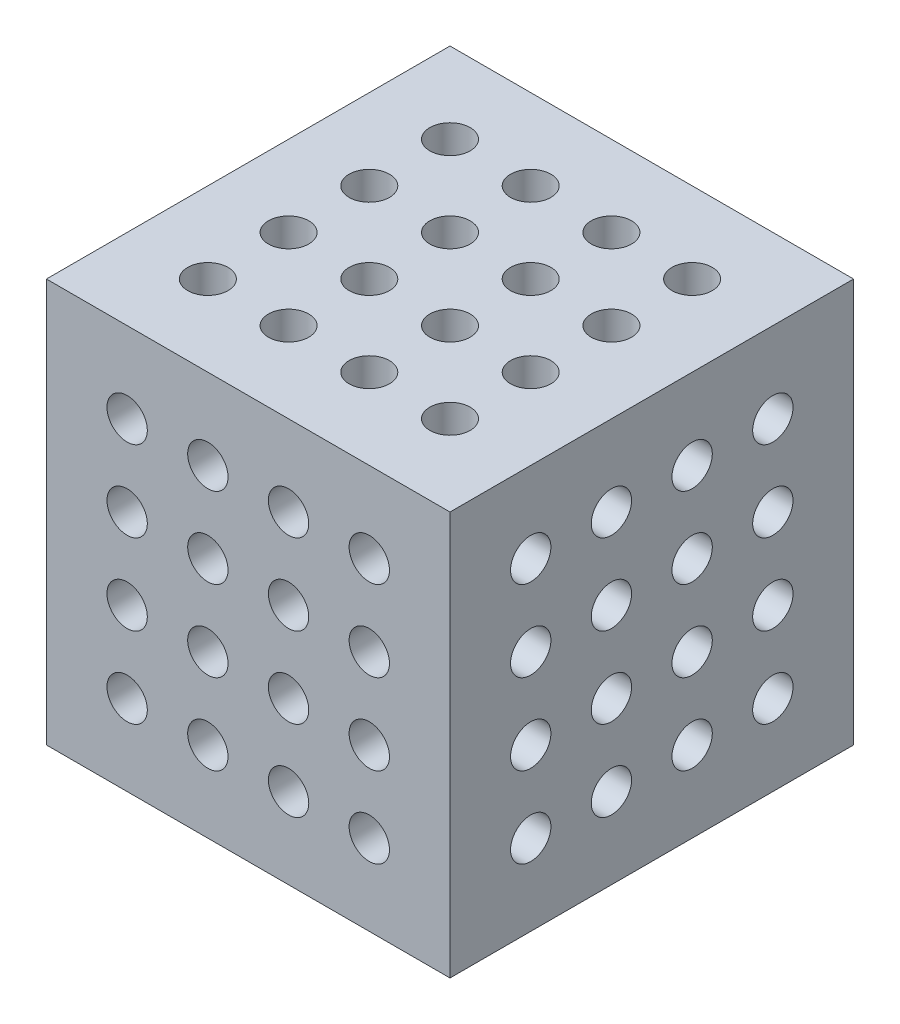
ISO-10303-21;
HEADER;
FILE_DESCRIPTION(('STEP AP214'),'2;1');
FILE_NAME('part.step','',(''),(''),'','','');
FILE_SCHEMA(('AUTOMOTIVE_DESIGN { 1 0 10303 214 1 1 1 1 }'));
ENDSEC;
DATA;
#1=APPLICATION_CONTEXT('core data for automotive mechanical design processes');
#2=APPLICATION_PROTOCOL_DEFINITION('international standard','automotive_design',2000,#1);
#3=PRODUCT_CONTEXT('',#1,'mechanical');
#4=PRODUCT('Part','Part','',(#3));
#5=PRODUCT_RELATED_PRODUCT_CATEGORY('part','',(#4));
#6=PRODUCT_DEFINITION_FORMATION('','',#4);
#7=PRODUCT_DEFINITION_CONTEXT('part definition',#1,'design');
#8=PRODUCT_DEFINITION('design','',#6,#7);
#9=PRODUCT_DEFINITION_SHAPE('','',#8);
#10=(LENGTH_UNIT() NAMED_UNIT(*) SI_UNIT(.MILLI.,.METRE.));
#11=(NAMED_UNIT(*) PLANE_ANGLE_UNIT() SI_UNIT($,.RADIAN.));
#12=(NAMED_UNIT(*) SI_UNIT($,.STERADIAN.) SOLID_ANGLE_UNIT());
#13=UNCERTAINTY_MEASURE_WITH_UNIT(LENGTH_MEASURE(1.E-05),#10,'distance_accuracy_value','');
#14=(GEOMETRIC_REPRESENTATION_CONTEXT(3) GLOBAL_UNCERTAINTY_ASSIGNED_CONTEXT((#13)) GLOBAL_UNIT_ASSIGNED_CONTEXT((#10,
#11,#12)) REPRESENTATION_CONTEXT('',''));
#15=CARTESIAN_POINT('',(0.,0.,0.));
#16=DIRECTION('',(0.,0.,1.));
#17=DIRECTION('',(1.,0.,0.));
#18=AXIS2_PLACEMENT_3D('',#15,#16,#17);
#19=CARTESIAN_POINT('',(0.,0.,50.));
#20=DIRECTION('',(1.,0.,0.));
#21=DIRECTION('',(0.,0.,-1.));
#22=AXIS2_PLACEMENT_3D('',#19,#20,#21);
#23=PLANE('',#22);
#24=DIRECTION('',(0.,-1.,0.));
#25=VECTOR('',#24,1.);
#26=CARTESIAN_POINT('',(0.,0.,0.));
#27=LINE('',#26,#25);
#28=CARTESIAN_POINT('',(0.,50.,0.));
#29=VERTEX_POINT('',#28);
#30=CARTESIAN_POINT('',(0.,0.,0.));
#31=VERTEX_POINT('',#30);
#32=EDGE_CURVE('E100',#29,#31,#27,.T.);
#33=ORIENTED_EDGE('',*,*,#32,.T.);
#34=DIRECTION('',(0.,0.,-1.));
#35=VECTOR('',#34,1.);
#36=CARTESIAN_POINT('',(0.,0.,50.));
#37=LINE('',#36,#35);
#38=CARTESIAN_POINT('',(0.,0.,50.));
#39=VERTEX_POINT('',#38);
#40=EDGE_CURVE('E90',#39,#31,#37,.T.);
#41=ORIENTED_EDGE('',*,*,#40,.F.);
#42=DIRECTION('',(0.,-1.,0.));
#43=VECTOR('',#42,1.);
#44=CARTESIAN_POINT('',(0.,0.,50.));
#45=LINE('',#44,#43);
#46=CARTESIAN_POINT('',(0.,50.,50.));
#47=VERTEX_POINT('',#46);
#48=EDGE_CURVE('E84',#47,#39,#45,.T.);
#49=ORIENTED_EDGE('',*,*,#48,.F.);
#50=DIRECTION('',(0.,0.,-1.));
#51=VECTOR('',#50,1.);
#52=CARTESIAN_POINT('',(0.,50.,50.));
#53=LINE('',#52,#51);
#54=EDGE_CURVE('E96',#47,#29,#53,.T.);
#55=ORIENTED_EDGE('',*,*,#54,.T.);
#56=EDGE_LOOP('',(#33,#41,#49,#55));
#57=FACE_BOUND('',#56,.T.);
#58=ADVANCED_FACE('F30',(#57),#23,.F.);
#59=CARTESIAN_POINT('',(0.,0.,50.));
#60=DIRECTION('',(0.,1.,0.));
#61=DIRECTION('',(0.,0.,1.));
#62=AXIS2_PLACEMENT_3D('',#59,#60,#61);
#63=PLANE('',#62);
#64=DIRECTION('',(1.,0.,0.));
#65=VECTOR('',#64,1.);
#66=CARTESIAN_POINT('',(0.,0.,0.));
#67=LINE('',#66,#65);
#68=CARTESIAN_POINT('',(50.,0.,0.));
#69=VERTEX_POINT('',#68);
#70=EDGE_CURVE('E89',#31,#69,#67,.T.);
#71=ORIENTED_EDGE('',*,*,#70,.T.);
#72=DIRECTION('',(0.,0.,-1.));
#73=VECTOR('',#72,1.);
#74=CARTESIAN_POINT('',(50.,0.,50.));
#75=LINE('',#74,#73);
#76=CARTESIAN_POINT('',(50.,0.,50.));
#77=VERTEX_POINT('',#76);
#78=EDGE_CURVE('E87',#77,#69,#75,.T.);
#79=ORIENTED_EDGE('',*,*,#78,.F.);
#80=DIRECTION('',(1.,0.,0.));
#81=VECTOR('',#80,1.);
#82=CARTESIAN_POINT('',(0.,0.,50.));
#83=LINE('',#82,#81);
#84=EDGE_CURVE('E78',#39,#77,#83,.T.);
#85=ORIENTED_EDGE('',*,*,#84,.F.);
#86=ORIENTED_EDGE('',*,*,#40,.T.);
#87=EDGE_LOOP('',(#71,#79,#85,#86));
#88=FACE_BOUND('',#87,.T.);
#89=ADVANCED_FACE('F88',(#88),#63,.F.);
#90=CARTESIAN_POINT('',(50.,0.,50.));
#91=DIRECTION('',(-1.,0.,0.));
#92=DIRECTION('',(0.,0.,1.));
#93=AXIS2_PLACEMENT_3D('',#90,#91,#92);
#94=PLANE('',#93);
#95=CARTESIAN_POINT('',(50.,40.,30.));
#96=DIRECTION('',(1.,0.,0.));
#97=DIRECTION('',(0.,0.,-1.));
#98=AXIS2_PLACEMENT_3D('',#95,#96,#97);
#99=CIRCLE('',#98,2.5);
#100=CARTESIAN_POINT('',(50.,40.,27.5));
#101=VERTEX_POINT('',#100);
#102=EDGE_CURVE('E1435',#101,#101,#99,.T.);
#103=ORIENTED_EDGE('',*,*,#102,.F.);
#104=EDGE_LOOP('',(#103));
#105=FACE_BOUND('',#104,.T.);
#106=CARTESIAN_POINT('',(50.,40.,40.));
#107=DIRECTION('',(1.,0.,0.));
#108=DIRECTION('',(0.,0.,-1.));
#109=AXIS2_PLACEMENT_3D('',#106,#107,#108);
#110=CIRCLE('',#109,2.5);
#111=CARTESIAN_POINT('',(50.,40.,37.5));
#112=VERTEX_POINT('',#111);
#113=EDGE_CURVE('E1427',#112,#112,#110,.T.);
#114=ORIENTED_EDGE('',*,*,#113,.F.);
#115=EDGE_LOOP('',(#114));
#116=FACE_BOUND('',#115,.T.);
#117=DIRECTION('',(0.,1.,0.));
#118=VECTOR('',#117,1.);
#119=CARTESIAN_POINT('',(50.,0.,0.));
#120=LINE('',#119,#118);
#121=CARTESIAN_POINT('',(50.,50.,0.));
#122=VERTEX_POINT('',#121);
#123=EDGE_CURVE('E64',#69,#122,#120,.T.);
#124=ORIENTED_EDGE('',*,*,#123,.T.);
#125=DIRECTION('',(0.,0.,-1.));
#126=VECTOR('',#125,1.);
#127=CARTESIAN_POINT('',(50.,50.,50.));
#128=LINE('',#127,#126);
#129=CARTESIAN_POINT('',(50.,50.,50.));
#130=VERTEX_POINT('',#129);
#131=EDGE_CURVE('E91',#130,#122,#128,.T.);
#132=ORIENTED_EDGE('',*,*,#131,.F.);
#133=DIRECTION('',(0.,1.,0.));
#134=VECTOR('',#133,1.);
#135=CARTESIAN_POINT('',(50.,0.,50.));
#136=LINE('',#135,#134);
#137=EDGE_CURVE('E82',#77,#130,#136,.T.);
#138=ORIENTED_EDGE('',*,*,#137,.F.);
#139=ORIENTED_EDGE('',*,*,#78,.T.);
#140=EDGE_LOOP('',(#124,#132,#138,#139));
#141=FACE_BOUND('',#140,.T.);
#142=CARTESIAN_POINT('',(50.,40.,20.));
#143=DIRECTION('',(1.,0.,0.));
#144=DIRECTION('',(0.,0.,-1.));
#145=AXIS2_PLACEMENT_3D('',#142,#143,#144);
#146=CIRCLE('',#145,2.5);
#147=CARTESIAN_POINT('',(50.,40.,17.5));
#148=VERTEX_POINT('',#147);
#149=EDGE_CURVE('E194',#148,#148,#146,.T.);
#150=ORIENTED_EDGE('',*,*,#149,.F.);
#151=EDGE_LOOP('',(#150));
#152=FACE_BOUND('',#151,.T.);
#153=CARTESIAN_POINT('',(50.,40.,10.));
#154=DIRECTION('',(1.,0.,0.));
#155=DIRECTION('',(0.,0.,-1.));
#156=AXIS2_PLACEMENT_3D('',#153,#154,#155);
#157=CIRCLE('',#156,2.5);
#158=CARTESIAN_POINT('',(50.,40.,7.5));
#159=VERTEX_POINT('',#158);
#160=EDGE_CURVE('E200',#159,#159,#157,.T.);
#161=ORIENTED_EDGE('',*,*,#160,.F.);
#162=EDGE_LOOP('',(#161));
#163=FACE_BOUND('',#162,.T.);
#164=CARTESIAN_POINT('',(50.,30.,40.));
#165=DIRECTION('',(1.,0.,0.));
#166=DIRECTION('',(0.,0.,-1.));
#167=AXIS2_PLACEMENT_3D('',#164,#165,#166);
#168=CIRCLE('',#167,2.5);
#169=CARTESIAN_POINT('',(50.,30.,37.5));
#170=VERTEX_POINT('',#169);
#171=EDGE_CURVE('E206',#170,#170,#168,.T.);
#172=ORIENTED_EDGE('',*,*,#171,.F.);
#173=EDGE_LOOP('',(#172));
#174=FACE_BOUND('',#173,.T.);
#175=CARTESIAN_POINT('',(50.,30.,30.));
#176=DIRECTION('',(1.,0.,0.));
#177=DIRECTION('',(0.,0.,-1.));
#178=AXIS2_PLACEMENT_3D('',#175,#176,#177);
#179=CIRCLE('',#178,2.5);
#180=CARTESIAN_POINT('',(50.,30.,27.5));
#181=VERTEX_POINT('',#180);
#182=EDGE_CURVE('E212',#181,#181,#179,.T.);
#183=ORIENTED_EDGE('',*,*,#182,.F.);
#184=EDGE_LOOP('',(#183));
#185=FACE_BOUND('',#184,.T.);
#186=CARTESIAN_POINT('',(50.,30.,20.));
#187=DIRECTION('',(1.,0.,0.));
#188=DIRECTION('',(0.,0.,-1.));
#189=AXIS2_PLACEMENT_3D('',#186,#187,#188);
#190=CIRCLE('',#189,2.5);
#191=CARTESIAN_POINT('',(50.,30.,17.5));
#192=VERTEX_POINT('',#191);
#193=EDGE_CURVE('E218',#192,#192,#190,.T.);
#194=ORIENTED_EDGE('',*,*,#193,.F.);
#195=EDGE_LOOP('',(#194));
#196=FACE_BOUND('',#195,.T.);
#197=CARTESIAN_POINT('',(50.,30.,10.));
#198=DIRECTION('',(1.,0.,0.));
#199=DIRECTION('',(0.,0.,-1.));
#200=AXIS2_PLACEMENT_3D('',#197,#198,#199);
#201=CIRCLE('',#200,2.5);
#202=CARTESIAN_POINT('',(50.,30.,7.5));
#203=VERTEX_POINT('',#202);
#204=EDGE_CURVE('E224',#203,#203,#201,.T.);
#205=ORIENTED_EDGE('',*,*,#204,.F.);
#206=EDGE_LOOP('',(#205));
#207=FACE_BOUND('',#206,.T.);
#208=CARTESIAN_POINT('',(50.,20.,40.));
#209=DIRECTION('',(1.,0.,0.));
#210=DIRECTION('',(0.,0.,-1.));
#211=AXIS2_PLACEMENT_3D('',#208,#209,#210);
#212=CIRCLE('',#211,2.5);
#213=CARTESIAN_POINT('',(50.,20.,37.5));
#214=VERTEX_POINT('',#213);
#215=EDGE_CURVE('E230',#214,#214,#212,.T.);
#216=ORIENTED_EDGE('',*,*,#215,.F.);
#217=EDGE_LOOP('',(#216));
#218=FACE_BOUND('',#217,.T.);
#219=CARTESIAN_POINT('',(50.,20.,30.));
#220=DIRECTION('',(1.,0.,0.));
#221=DIRECTION('',(0.,0.,-1.));
#222=AXIS2_PLACEMENT_3D('',#219,#220,#221);
#223=CIRCLE('',#222,2.5);
#224=CARTESIAN_POINT('',(50.,20.,27.5));
#225=VERTEX_POINT('',#224);
#226=EDGE_CURVE('E236',#225,#225,#223,.T.);
#227=ORIENTED_EDGE('',*,*,#226,.F.);
#228=EDGE_LOOP('',(#227));
#229=FACE_BOUND('',#228,.T.);
#230=CARTESIAN_POINT('',(50.,20.,20.));
#231=DIRECTION('',(1.,0.,0.));
#232=DIRECTION('',(0.,0.,-1.));
#233=AXIS2_PLACEMENT_3D('',#230,#231,#232);
#234=CIRCLE('',#233,2.5);
#235=CARTESIAN_POINT('',(50.,20.,17.5));
#236=VERTEX_POINT('',#235);
#237=EDGE_CURVE('E242',#236,#236,#234,.T.);
#238=ORIENTED_EDGE('',*,*,#237,.F.);
#239=EDGE_LOOP('',(#238));
#240=FACE_BOUND('',#239,.T.);
#241=CARTESIAN_POINT('',(50.,20.,10.));
#242=DIRECTION('',(1.,0.,0.));
#243=DIRECTION('',(0.,0.,-1.));
#244=AXIS2_PLACEMENT_3D('',#241,#242,#243);
#245=CIRCLE('',#244,2.5);
#246=CARTESIAN_POINT('',(50.,20.,7.5));
#247=VERTEX_POINT('',#246);
#248=EDGE_CURVE('E248',#247,#247,#245,.T.);
#249=ORIENTED_EDGE('',*,*,#248,.F.);
#250=EDGE_LOOP('',(#249));
#251=FACE_BOUND('',#250,.T.);
#252=CARTESIAN_POINT('',(50.,10.,40.));
#253=DIRECTION('',(1.,0.,0.));
#254=DIRECTION('',(0.,0.,-1.));
#255=AXIS2_PLACEMENT_3D('',#252,#253,#254);
#256=CIRCLE('',#255,2.5);
#257=CARTESIAN_POINT('',(50.,10.,37.5));
#258=VERTEX_POINT('',#257);
#259=EDGE_CURVE('E254',#258,#258,#256,.T.);
#260=ORIENTED_EDGE('',*,*,#259,.F.);
#261=EDGE_LOOP('',(#260));
#262=FACE_BOUND('',#261,.T.);
#263=CARTESIAN_POINT('',(50.,10.,30.));
#264=DIRECTION('',(1.,0.,0.));
#265=DIRECTION('',(0.,0.,-1.));
#266=AXIS2_PLACEMENT_3D('',#263,#264,#265);
#267=CIRCLE('',#266,2.5);
#268=CARTESIAN_POINT('',(50.,10.,27.5));
#269=VERTEX_POINT('',#268);
#270=EDGE_CURVE('E260',#269,#269,#267,.T.);
#271=ORIENTED_EDGE('',*,*,#270,.F.);
#272=EDGE_LOOP('',(#271));
#273=FACE_BOUND('',#272,.T.);
#274=CARTESIAN_POINT('',(50.,10.,20.));
#275=DIRECTION('',(1.,0.,0.));
#276=DIRECTION('',(0.,0.,-1.));
#277=AXIS2_PLACEMENT_3D('',#274,#275,#276);
#278=CIRCLE('',#277,2.5);
#279=CARTESIAN_POINT('',(50.,10.,17.5));
#280=VERTEX_POINT('',#279);
#281=EDGE_CURVE('E266',#280,#280,#278,.T.);
#282=ORIENTED_EDGE('',*,*,#281,.F.);
#283=EDGE_LOOP('',(#282));
#284=FACE_BOUND('',#283,.T.);
#285=CARTESIAN_POINT('',(50.,10.,10.));
#286=DIRECTION('',(1.,0.,0.));
#287=DIRECTION('',(0.,0.,-1.));
#288=AXIS2_PLACEMENT_3D('',#285,#286,#287);
#289=CIRCLE('',#288,2.5);
#290=CARTESIAN_POINT('',(50.,10.,7.5));
#291=VERTEX_POINT('',#290);
#292=EDGE_CURVE('E272',#291,#291,#289,.T.);
#293=ORIENTED_EDGE('',*,*,#292,.F.);
#294=EDGE_LOOP('',(#293));
#295=FACE_BOUND('',#294,.T.);
#296=ADVANCED_FACE('F93',(#105,#116,#141,#152,#163,#174,#185,#196,#207,#218,#229,#240,#251,#262,
#273,#284,#295),#94,.F.);
#297=CARTESIAN_POINT('',(0.,50.,50.));
#298=DIRECTION('',(0.,-1.,0.));
#299=DIRECTION('',(0.,0.,-1.));
#300=AXIS2_PLACEMENT_3D('',#297,#298,#299);
#301=PLANE('',#300);
#302=CARTESIAN_POINT('',(10.,50.,30.));
#303=DIRECTION('',(0.,1.,0.));
#304=DIRECTION('',(0.,0.,1.));
#305=AXIS2_PLACEMENT_3D('',#302,#303,#304);
#306=CIRCLE('',#305,2.5);
#307=CARTESIAN_POINT('',(10.,50.,32.5));
#308=VERTEX_POINT('',#307);
#309=EDGE_CURVE('E1447',#308,#308,#306,.T.);
#310=ORIENTED_EDGE('',*,*,#309,.F.);
#311=EDGE_LOOP('',(#310));
#312=FACE_BOUND('',#311,.T.);
#313=CARTESIAN_POINT('',(10.,50.,40.));
#314=DIRECTION('',(0.,1.,0.));
#315=DIRECTION('',(0.,0.,1.));
#316=AXIS2_PLACEMENT_3D('',#313,#314,#315);
#317=CIRCLE('',#316,2.5);
#318=CARTESIAN_POINT('',(10.,50.,42.5));
#319=VERTEX_POINT('',#318);
#320=EDGE_CURVE('E1439',#319,#319,#317,.T.);
#321=ORIENTED_EDGE('',*,*,#320,.F.);
#322=EDGE_LOOP('',(#321));
#323=FACE_BOUND('',#322,.T.);
#324=DIRECTION('',(-1.,0.,0.));
#325=VECTOR('',#324,1.);
#326=CARTESIAN_POINT('',(0.,50.,0.));
#327=LINE('',#326,#325);
#328=EDGE_CURVE('E70',#122,#29,#327,.T.);
#329=ORIENTED_EDGE('',*,*,#328,.T.);
#330=ORIENTED_EDGE('',*,*,#54,.F.);
#331=DIRECTION('',(-1.,0.,0.));
#332=VECTOR('',#331,1.);
#333=CARTESIAN_POINT('',(0.,50.,50.));
#334=LINE('',#333,#332);
#335=EDGE_CURVE('E47',#130,#47,#334,.T.);
#336=ORIENTED_EDGE('',*,*,#335,.F.);
#337=ORIENTED_EDGE('',*,*,#131,.T.);
#338=EDGE_LOOP('',(#329,#330,#336,#337));
#339=FACE_BOUND('',#338,.T.);
#340=CARTESIAN_POINT('',(10.,50.,20.));
#341=DIRECTION('',(0.,1.,0.));
#342=DIRECTION('',(0.,0.,1.));
#343=AXIS2_PLACEMENT_3D('',#340,#341,#342);
#344=CIRCLE('',#343,2.5);
#345=CARTESIAN_POINT('',(10.,50.,22.5));
#346=VERTEX_POINT('',#345);
#347=EDGE_CURVE('E278',#346,#346,#344,.T.);
#348=ORIENTED_EDGE('',*,*,#347,.F.);
#349=EDGE_LOOP('',(#348));
#350=FACE_BOUND('',#349,.T.);
#351=CARTESIAN_POINT('',(10.,50.,10.));
#352=DIRECTION('',(0.,1.,0.));
#353=DIRECTION('',(0.,0.,1.));
#354=AXIS2_PLACEMENT_3D('',#351,#352,#353);
#355=CIRCLE('',#354,2.5);
#356=CARTESIAN_POINT('',(10.,50.,12.5));
#357=VERTEX_POINT('',#356);
#358=EDGE_CURVE('E284',#357,#357,#355,.T.);
#359=ORIENTED_EDGE('',*,*,#358,.F.);
#360=EDGE_LOOP('',(#359));
#361=FACE_BOUND('',#360,.T.);
#362=CARTESIAN_POINT('',(20.,50.,40.));
#363=DIRECTION('',(0.,1.,0.));
#364=DIRECTION('',(0.,0.,1.));
#365=AXIS2_PLACEMENT_3D('',#362,#363,#364);
#366=CIRCLE('',#365,2.5);
#367=CARTESIAN_POINT('',(20.,50.,42.5));
#368=VERTEX_POINT('',#367);
#369=EDGE_CURVE('E290',#368,#368,#366,.T.);
#370=ORIENTED_EDGE('',*,*,#369,.F.);
#371=EDGE_LOOP('',(#370));
#372=FACE_BOUND('',#371,.T.);
#373=CARTESIAN_POINT('',(20.,50.,30.));
#374=DIRECTION('',(0.,1.,0.));
#375=DIRECTION('',(0.,0.,1.));
#376=AXIS2_PLACEMENT_3D('',#373,#374,#375);
#377=CIRCLE('',#376,2.5);
#378=CARTESIAN_POINT('',(20.,50.,32.5));
#379=VERTEX_POINT('',#378);
#380=EDGE_CURVE('E296',#379,#379,#377,.T.);
#381=ORIENTED_EDGE('',*,*,#380,.F.);
#382=EDGE_LOOP('',(#381));
#383=FACE_BOUND('',#382,.T.);
#384=CARTESIAN_POINT('',(20.,50.,20.));
#385=DIRECTION('',(0.,1.,0.));
#386=DIRECTION('',(0.,0.,1.));
#387=AXIS2_PLACEMENT_3D('',#384,#385,#386);
#388=CIRCLE('',#387,2.5);
#389=CARTESIAN_POINT('',(20.,50.,22.5));
#390=VERTEX_POINT('',#389);
#391=EDGE_CURVE('E302',#390,#390,#388,.T.);
#392=ORIENTED_EDGE('',*,*,#391,.F.);
#393=EDGE_LOOP('',(#392));
#394=FACE_BOUND('',#393,.T.);
#395=CARTESIAN_POINT('',(20.,50.,10.));
#396=DIRECTION('',(0.,1.,0.));
#397=DIRECTION('',(0.,0.,1.));
#398=AXIS2_PLACEMENT_3D('',#395,#396,#397);
#399=CIRCLE('',#398,2.5);
#400=CARTESIAN_POINT('',(20.,50.,12.5));
#401=VERTEX_POINT('',#400);
#402=EDGE_CURVE('E308',#401,#401,#399,.T.);
#403=ORIENTED_EDGE('',*,*,#402,.F.);
#404=EDGE_LOOP('',(#403));
#405=FACE_BOUND('',#404,.T.);
#406=CARTESIAN_POINT('',(30.,50.,40.));
#407=DIRECTION('',(0.,1.,0.));
#408=DIRECTION('',(0.,0.,1.));
#409=AXIS2_PLACEMENT_3D('',#406,#407,#408);
#410=CIRCLE('',#409,2.5);
#411=CARTESIAN_POINT('',(30.,50.,42.5));
#412=VERTEX_POINT('',#411);
#413=EDGE_CURVE('E314',#412,#412,#410,.T.);
#414=ORIENTED_EDGE('',*,*,#413,.F.);
#415=EDGE_LOOP('',(#414));
#416=FACE_BOUND('',#415,.T.);
#417=CARTESIAN_POINT('',(30.,50.,30.));
#418=DIRECTION('',(0.,1.,0.));
#419=DIRECTION('',(0.,0.,1.));
#420=AXIS2_PLACEMENT_3D('',#417,#418,#419);
#421=CIRCLE('',#420,2.5);
#422=CARTESIAN_POINT('',(30.,50.,32.5));
#423=VERTEX_POINT('',#422);
#424=EDGE_CURVE('E320',#423,#423,#421,.T.);
#425=ORIENTED_EDGE('',*,*,#424,.F.);
#426=EDGE_LOOP('',(#425));
#427=FACE_BOUND('',#426,.T.);
#428=CARTESIAN_POINT('',(30.,50.,20.));
#429=DIRECTION('',(0.,1.,0.));
#430=DIRECTION('',(0.,0.,1.));
#431=AXIS2_PLACEMENT_3D('',#428,#429,#430);
#432=CIRCLE('',#431,2.5);
#433=CARTESIAN_POINT('',(30.,50.,22.5));
#434=VERTEX_POINT('',#433);
#435=EDGE_CURVE('E326',#434,#434,#432,.T.);
#436=ORIENTED_EDGE('',*,*,#435,.F.);
#437=EDGE_LOOP('',(#436));
#438=FACE_BOUND('',#437,.T.);
#439=CARTESIAN_POINT('',(30.,50.,10.));
#440=DIRECTION('',(0.,1.,0.));
#441=DIRECTION('',(0.,0.,1.));
#442=AXIS2_PLACEMENT_3D('',#439,#440,#441);
#443=CIRCLE('',#442,2.5);
#444=CARTESIAN_POINT('',(30.,50.,12.5));
#445=VERTEX_POINT('',#444);
#446=EDGE_CURVE('E332',#445,#445,#443,.T.);
#447=ORIENTED_EDGE('',*,*,#446,.F.);
#448=EDGE_LOOP('',(#447));
#449=FACE_BOUND('',#448,.T.);
#450=CARTESIAN_POINT('',(40.,50.,40.));
#451=DIRECTION('',(0.,1.,0.));
#452=DIRECTION('',(0.,0.,1.));
#453=AXIS2_PLACEMENT_3D('',#450,#451,#452);
#454=CIRCLE('',#453,2.5);
#455=CARTESIAN_POINT('',(40.,50.,42.5));
#456=VERTEX_POINT('',#455);
#457=EDGE_CURVE('E338',#456,#456,#454,.T.);
#458=ORIENTED_EDGE('',*,*,#457,.F.);
#459=EDGE_LOOP('',(#458));
#460=FACE_BOUND('',#459,.T.);
#461=CARTESIAN_POINT('',(40.,50.,30.));
#462=DIRECTION('',(0.,1.,0.));
#463=DIRECTION('',(0.,0.,1.));
#464=AXIS2_PLACEMENT_3D('',#461,#462,#463);
#465=CIRCLE('',#464,2.5);
#466=CARTESIAN_POINT('',(40.,50.,32.5));
#467=VERTEX_POINT('',#466);
#468=EDGE_CURVE('E344',#467,#467,#465,.T.);
#469=ORIENTED_EDGE('',*,*,#468,.F.);
#470=EDGE_LOOP('',(#469));
#471=FACE_BOUND('',#470,.T.);
#472=CARTESIAN_POINT('',(40.,50.,20.));
#473=DIRECTION('',(0.,1.,0.));
#474=DIRECTION('',(0.,0.,1.));
#475=AXIS2_PLACEMENT_3D('',#472,#473,#474);
#476=CIRCLE('',#475,2.5);
#477=CARTESIAN_POINT('',(40.,50.,22.5));
#478=VERTEX_POINT('',#477);
#479=EDGE_CURVE('E350',#478,#478,#476,.T.);
#480=ORIENTED_EDGE('',*,*,#479,.F.);
#481=EDGE_LOOP('',(#480));
#482=FACE_BOUND('',#481,.T.);
#483=CARTESIAN_POINT('',(40.,50.,10.));
#484=DIRECTION('',(0.,1.,0.));
#485=DIRECTION('',(0.,0.,1.));
#486=AXIS2_PLACEMENT_3D('',#483,#484,#485);
#487=CIRCLE('',#486,2.5);
#488=CARTESIAN_POINT('',(40.,50.,12.5));
#489=VERTEX_POINT('',#488);
#490=EDGE_CURVE('E39',#489,#489,#487,.T.);
#491=ORIENTED_EDGE('',*,*,#490,.F.);
#492=EDGE_LOOP('',(#491));
#493=FACE_BOUND('',#492,.T.);
#494=ADVANCED_FACE('F360',(#312,#323,#339,#350,#361,#372,#383,#394,#405,#416,#427,#438,#449,
#460,#471,#482,#493),#301,.F.);
#495=CARTESIAN_POINT('',(0.,50.,50.));
#496=DIRECTION('',(0.,0.,-1.));
#497=DIRECTION('',(-1.,0.,0.));
#498=AXIS2_PLACEMENT_3D('',#495,#496,#497);
#499=PLANE('',#498);
#500=CARTESIAN_POINT('',(20.,40.,50.));
#501=DIRECTION('',(0.,0.,1.));
#502=DIRECTION('',(1.,0.,0.));
#503=AXIS2_PLACEMENT_3D('',#500,#501,#502);
#504=CIRCLE('',#503,2.5);
#505=CARTESIAN_POINT('',(22.5,40.,50.));
#506=VERTEX_POINT('',#505);
#507=EDGE_CURVE('E1423',#506,#506,#504,.T.);
#508=ORIENTED_EDGE('',*,*,#507,.F.);
#509=EDGE_LOOP('',(#508));
#510=FACE_BOUND('',#509,.T.);
#511=CARTESIAN_POINT('',(10.,40.,50.));
#512=DIRECTION('',(0.,0.,1.));
#513=DIRECTION('',(1.,0.,0.));
#514=AXIS2_PLACEMENT_3D('',#511,#512,#513);
#515=CIRCLE('',#514,2.5);
#516=CARTESIAN_POINT('',(12.5,40.,50.));
#517=VERTEX_POINT('',#516);
#518=EDGE_CURVE('E1415',#517,#517,#515,.T.);
#519=ORIENTED_EDGE('',*,*,#518,.F.);
#520=EDGE_LOOP('',(#519));
#521=FACE_BOUND('',#520,.T.);
#522=ORIENTED_EDGE('',*,*,#48,.T.);
#523=ORIENTED_EDGE('',*,*,#84,.T.);
#524=ORIENTED_EDGE('',*,*,#137,.T.);
#525=ORIENTED_EDGE('',*,*,#335,.T.);
#526=EDGE_LOOP('',(#522,#523,#524,#525));
#527=FACE_BOUND('',#526,.T.);
#528=CARTESIAN_POINT('',(30.,40.,50.));
#529=DIRECTION('',(0.,0.,1.));
#530=DIRECTION('',(1.,0.,0.));
#531=AXIS2_PLACEMENT_3D('',#528,#529,#530);
#532=CIRCLE('',#531,2.5);
#533=CARTESIAN_POINT('',(32.5,40.,50.));
#534=VERTEX_POINT('',#533);
#535=EDGE_CURVE('E110',#534,#534,#532,.T.);
#536=ORIENTED_EDGE('',*,*,#535,.F.);
#537=EDGE_LOOP('',(#536));
#538=FACE_BOUND('',#537,.T.);
#539=CARTESIAN_POINT('',(40.,40.,50.));
#540=DIRECTION('',(0.,0.,1.));
#541=DIRECTION('',(1.,0.,0.));
#542=AXIS2_PLACEMENT_3D('',#539,#540,#541);
#543=CIRCLE('',#542,2.5);
#544=CARTESIAN_POINT('',(42.5,40.,50.));
#545=VERTEX_POINT('',#544);
#546=EDGE_CURVE('E116',#545,#545,#543,.T.);
#547=ORIENTED_EDGE('',*,*,#546,.F.);
#548=EDGE_LOOP('',(#547));
#549=FACE_BOUND('',#548,.T.);
#550=CARTESIAN_POINT('',(10.,30.,50.));
#551=DIRECTION('',(0.,0.,1.));
#552=DIRECTION('',(1.,0.,0.));
#553=AXIS2_PLACEMENT_3D('',#550,#551,#552);
#554=CIRCLE('',#553,2.5);
#555=CARTESIAN_POINT('',(12.5,30.,50.));
#556=VERTEX_POINT('',#555);
#557=EDGE_CURVE('E122',#556,#556,#554,.T.);
#558=ORIENTED_EDGE('',*,*,#557,.F.);
#559=EDGE_LOOP('',(#558));
#560=FACE_BOUND('',#559,.T.);
#561=CARTESIAN_POINT('',(20.,30.,50.));
#562=DIRECTION('',(0.,0.,1.));
#563=DIRECTION('',(1.,0.,0.));
#564=AXIS2_PLACEMENT_3D('',#561,#562,#563);
#565=CIRCLE('',#564,2.5);
#566=CARTESIAN_POINT('',(22.5,30.,50.));
#567=VERTEX_POINT('',#566);
#568=EDGE_CURVE('E128',#567,#567,#565,.T.);
#569=ORIENTED_EDGE('',*,*,#568,.F.);
#570=EDGE_LOOP('',(#569));
#571=FACE_BOUND('',#570,.T.);
#572=CARTESIAN_POINT('',(30.,30.,50.));
#573=DIRECTION('',(0.,0.,1.));
#574=DIRECTION('',(1.,0.,0.));
#575=AXIS2_PLACEMENT_3D('',#572,#573,#574);
#576=CIRCLE('',#575,2.5);
#577=CARTESIAN_POINT('',(32.5,30.,50.));
#578=VERTEX_POINT('',#577);
#579=EDGE_CURVE('E134',#578,#578,#576,.T.);
#580=ORIENTED_EDGE('',*,*,#579,.F.);
#581=EDGE_LOOP('',(#580));
#582=FACE_BOUND('',#581,.T.);
#583=CARTESIAN_POINT('',(40.,30.,50.));
#584=DIRECTION('',(0.,0.,1.));
#585=DIRECTION('',(1.,0.,0.));
#586=AXIS2_PLACEMENT_3D('',#583,#584,#585);
#587=CIRCLE('',#586,2.5);
#588=CARTESIAN_POINT('',(42.5,30.,50.));
#589=VERTEX_POINT('',#588);
#590=EDGE_CURVE('E140',#589,#589,#587,.T.);
#591=ORIENTED_EDGE('',*,*,#590,.F.);
#592=EDGE_LOOP('',(#591));
#593=FACE_BOUND('',#592,.T.);
#594=CARTESIAN_POINT('',(10.,20.,50.));
#595=DIRECTION('',(0.,0.,1.));
#596=DIRECTION('',(1.,0.,0.));
#597=AXIS2_PLACEMENT_3D('',#594,#595,#596);
#598=CIRCLE('',#597,2.5);
#599=CARTESIAN_POINT('',(12.5,20.,50.));
#600=VERTEX_POINT('',#599);
#601=EDGE_CURVE('E146',#600,#600,#598,.T.);
#602=ORIENTED_EDGE('',*,*,#601,.F.);
#603=EDGE_LOOP('',(#602));
#604=FACE_BOUND('',#603,.T.);
#605=CARTESIAN_POINT('',(20.,20.,50.));
#606=DIRECTION('',(0.,0.,1.));
#607=DIRECTION('',(1.,0.,0.));
#608=AXIS2_PLACEMENT_3D('',#605,#606,#607);
#609=CIRCLE('',#608,2.5);
#610=CARTESIAN_POINT('',(22.5,20.,50.));
#611=VERTEX_POINT('',#610);
#612=EDGE_CURVE('E152',#611,#611,#609,.T.);
#613=ORIENTED_EDGE('',*,*,#612,.F.);
#614=EDGE_LOOP('',(#613));
#615=FACE_BOUND('',#614,.T.);
#616=CARTESIAN_POINT('',(30.,20.,50.));
#617=DIRECTION('',(0.,0.,1.));
#618=DIRECTION('',(1.,0.,0.));
#619=AXIS2_PLACEMENT_3D('',#616,#617,#618);
#620=CIRCLE('',#619,2.5);
#621=CARTESIAN_POINT('',(32.5,20.,50.));
#622=VERTEX_POINT('',#621);
#623=EDGE_CURVE('E158',#622,#622,#620,.T.);
#624=ORIENTED_EDGE('',*,*,#623,.F.);
#625=EDGE_LOOP('',(#624));
#626=FACE_BOUND('',#625,.T.);
#627=CARTESIAN_POINT('',(40.,20.,50.));
#628=DIRECTION('',(0.,0.,1.));
#629=DIRECTION('',(1.,0.,0.));
#630=AXIS2_PLACEMENT_3D('',#627,#628,#629);
#631=CIRCLE('',#630,2.5);
#632=CARTESIAN_POINT('',(42.5,20.,50.));
#633=VERTEX_POINT('',#632);
#634=EDGE_CURVE('E164',#633,#633,#631,.T.);
#635=ORIENTED_EDGE('',*,*,#634,.F.);
#636=EDGE_LOOP('',(#635));
#637=FACE_BOUND('',#636,.T.);
#638=CARTESIAN_POINT('',(10.,10.,50.));
#639=DIRECTION('',(0.,0.,1.));
#640=DIRECTION('',(1.,0.,0.));
#641=AXIS2_PLACEMENT_3D('',#638,#639,#640);
#642=CIRCLE('',#641,2.5);
#643=CARTESIAN_POINT('',(12.5,10.,50.));
#644=VERTEX_POINT('',#643);
#645=EDGE_CURVE('E170',#644,#644,#642,.T.);
#646=ORIENTED_EDGE('',*,*,#645,.F.);
#647=EDGE_LOOP('',(#646));
#648=FACE_BOUND('',#647,.T.);
#649=CARTESIAN_POINT('',(20.,10.,50.));
#650=DIRECTION('',(0.,0.,1.));
#651=DIRECTION('',(1.,0.,0.));
#652=AXIS2_PLACEMENT_3D('',#649,#650,#651);
#653=CIRCLE('',#652,2.5);
#654=CARTESIAN_POINT('',(22.5,10.,50.));
#655=VERTEX_POINT('',#654);
#656=EDGE_CURVE('E176',#655,#655,#653,.T.);
#657=ORIENTED_EDGE('',*,*,#656,.F.);
#658=EDGE_LOOP('',(#657));
#659=FACE_BOUND('',#658,.T.);
#660=CARTESIAN_POINT('',(30.,10.,50.));
#661=DIRECTION('',(0.,0.,1.));
#662=DIRECTION('',(1.,0.,0.));
#663=AXIS2_PLACEMENT_3D('',#660,#661,#662);
#664=CIRCLE('',#663,2.5);
#665=CARTESIAN_POINT('',(32.5,10.,50.));
#666=VERTEX_POINT('',#665);
#667=EDGE_CURVE('E182',#666,#666,#664,.T.);
#668=ORIENTED_EDGE('',*,*,#667,.F.);
#669=EDGE_LOOP('',(#668));
#670=FACE_BOUND('',#669,.T.);
#671=CARTESIAN_POINT('',(40.,10.,50.));
#672=DIRECTION('',(0.,0.,1.));
#673=DIRECTION('',(1.,0.,0.));
#674=AXIS2_PLACEMENT_3D('',#671,#672,#673);
#675=CIRCLE('',#674,2.5);
#676=CARTESIAN_POINT('',(42.5,10.,50.));
#677=VERTEX_POINT('',#676);
#678=EDGE_CURVE('E188',#677,#677,#675,.T.);
#679=ORIENTED_EDGE('',*,*,#678,.F.);
#680=EDGE_LOOP('',(#679));
#681=FACE_BOUND('',#680,.T.);
#682=ADVANCED_FACE('F79',(#510,#521,#527,#538,#549,#560,#571,#582,#593,#604,#615,#626,#637,#648,
#659,#670,#681),#499,.F.);
#683=CARTESIAN_POINT('',(0.,50.,0.));
#684=DIRECTION('',(0.,0.,-1.));
#685=DIRECTION('',(-1.,0.,0.));
#686=AXIS2_PLACEMENT_3D('',#683,#684,#685);
#687=PLANE('',#686);
#688=ORIENTED_EDGE('',*,*,#32,.F.);
#689=ORIENTED_EDGE('',*,*,#328,.F.);
#690=ORIENTED_EDGE('',*,*,#123,.F.);
#691=ORIENTED_EDGE('',*,*,#70,.F.);
#692=EDGE_LOOP('',(#688,#689,#690,#691));
#693=FACE_BOUND('',#692,.T.);
#694=ADVANCED_FACE('F368',(#693),#687,.T.);
#695=CARTESIAN_POINT('',(10.,40.,45.));
#696=DIRECTION('',(0.,0.,1.));
#697=DIRECTION('',(1.,0.,0.));
#698=AXIS2_PLACEMENT_3D('',#695,#696,#697);
#699=CYLINDRICAL_SURFACE('',#698,2.5);
#700=CARTESIAN_POINT('',(10.,40.,45.));
#701=DIRECTION('',(0.,0.,1.));
#702=DIRECTION('',(1.,0.,0.));
#703=AXIS2_PLACEMENT_3D('',#700,#701,#702);
#704=CIRCLE('',#703,2.5);
#705=CARTESIAN_POINT('',(12.5,40.,45.));
#706=VERTEX_POINT('',#705);
#707=EDGE_CURVE('E103',#706,#706,#704,.T.);
#708=ORIENTED_EDGE('',*,*,#707,.F.);
#709=EDGE_LOOP('',(#708));
#710=FACE_BOUND('',#709,.T.);
#711=ORIENTED_EDGE('',*,*,#518,.T.);
#712=EDGE_LOOP('',(#711));
#713=FACE_BOUND('',#712,.T.);
#714=ADVANCED_FACE('F1137',(#710,#713),#699,.F.);
#715=CARTESIAN_POINT('',(10.,40.,45.));
#716=DIRECTION('',(0.,0.,1.));
#717=DIRECTION('',(1.,0.,0.));
#718=AXIS2_PLACEMENT_3D('',#715,#716,#717);
#719=PLANE('',#718);
#720=ORIENTED_EDGE('',*,*,#707,.T.);
#721=EDGE_LOOP('',(#720));
#722=FACE_BOUND('',#721,.T.);
#723=ADVANCED_FACE('F1123',(#722),#719,.T.);
#724=CARTESIAN_POINT('',(20.,40.,45.));
#725=DIRECTION('',(0.,0.,1.));
#726=DIRECTION('',(1.,0.,0.));
#727=AXIS2_PLACEMENT_3D('',#724,#725,#726);
#728=CYLINDRICAL_SURFACE('',#727,2.5);
#729=CARTESIAN_POINT('',(20.,40.,45.));
#730=DIRECTION('',(0.,0.,1.));
#731=DIRECTION('',(1.,0.,0.));
#732=AXIS2_PLACEMENT_3D('',#729,#730,#731);
#733=CIRCLE('',#732,2.5);
#734=CARTESIAN_POINT('',(22.5,40.,45.));
#735=VERTEX_POINT('',#734);
#736=EDGE_CURVE('E1418',#735,#735,#733,.T.);
#737=ORIENTED_EDGE('',*,*,#736,.F.);
#738=EDGE_LOOP('',(#737));
#739=FACE_BOUND('',#738,.T.);
#740=ORIENTED_EDGE('',*,*,#507,.T.);
#741=EDGE_LOOP('',(#740));
#742=FACE_BOUND('',#741,.T.);
#743=ADVANCED_FACE('F394',(#739,#742),#728,.F.);
#744=CARTESIAN_POINT('',(20.,40.,45.));
#745=DIRECTION('',(0.,0.,1.));
#746=DIRECTION('',(1.,0.,0.));
#747=AXIS2_PLACEMENT_3D('',#744,#745,#746);
#748=PLANE('',#747);
#749=ORIENTED_EDGE('',*,*,#736,.T.);
#750=EDGE_LOOP('',(#749));
#751=FACE_BOUND('',#750,.T.);
#752=ADVANCED_FACE('F392',(#751),#748,.T.);
#753=CARTESIAN_POINT('',(30.,40.,45.));
#754=DIRECTION('',(0.,0.,1.));
#755=DIRECTION('',(1.,0.,0.));
#756=AXIS2_PLACEMENT_3D('',#753,#754,#755);
#757=PLANE('',#756);
#758=CARTESIAN_POINT('',(30.,40.,45.));
#759=DIRECTION('',(0.,0.,1.));
#760=DIRECTION('',(1.,0.,0.));
#761=AXIS2_PLACEMENT_3D('',#758,#759,#760);
#762=CIRCLE('',#761,2.5);
#763=CARTESIAN_POINT('',(32.5,40.,45.));
#764=VERTEX_POINT('',#763);
#765=EDGE_CURVE('E113',#764,#764,#762,.T.);
#766=ORIENTED_EDGE('',*,*,#765,.T.);
#767=EDGE_LOOP('',(#766));
#768=FACE_BOUND('',#767,.T.);
#769=ADVANCED_FACE('F388',(#768),#757,.T.);
#770=CARTESIAN_POINT('',(30.,40.,45.));
#771=DIRECTION('',(0.,0.,1.));
#772=DIRECTION('',(1.,0.,0.));
#773=AXIS2_PLACEMENT_3D('',#770,#771,#772);
#774=CYLINDRICAL_SURFACE('',#773,2.5);
#775=ORIENTED_EDGE('',*,*,#765,.F.);
#776=EDGE_LOOP('',(#775));
#777=FACE_BOUND('',#776,.T.);
#778=ORIENTED_EDGE('',*,*,#535,.T.);
#779=EDGE_LOOP('',(#778));
#780=FACE_BOUND('',#779,.T.);
#781=ADVANCED_FACE('F384',(#777,#780),#774,.F.);
#782=CARTESIAN_POINT('',(40.,40.,45.));
#783=DIRECTION('',(0.,0.,1.));
#784=DIRECTION('',(1.,0.,0.));
#785=AXIS2_PLACEMENT_3D('',#782,#783,#784);
#786=PLANE('',#785);
#787=CARTESIAN_POINT('',(40.,40.,45.));
#788=DIRECTION('',(0.,0.,1.));
#789=DIRECTION('',(1.,0.,0.));
#790=AXIS2_PLACEMENT_3D('',#787,#788,#789);
#791=CIRCLE('',#790,2.5);
#792=CARTESIAN_POINT('',(42.5,40.,45.));
#793=VERTEX_POINT('',#792);
#794=EDGE_CURVE('E119',#793,#793,#791,.T.);
#795=ORIENTED_EDGE('',*,*,#794,.T.);
#796=EDGE_LOOP('',(#795));
#797=FACE_BOUND('',#796,.T.);
#798=ADVANCED_FACE('F387',(#797),#786,.T.);
#799=CARTESIAN_POINT('',(40.,40.,45.));
#800=DIRECTION('',(0.,0.,1.));
#801=DIRECTION('',(1.,0.,0.));
#802=AXIS2_PLACEMENT_3D('',#799,#800,#801);
#803=CYLINDRICAL_SURFACE('',#802,2.5);
#804=ORIENTED_EDGE('',*,*,#794,.F.);
#805=EDGE_LOOP('',(#804));
#806=FACE_BOUND('',#805,.T.);
#807=ORIENTED_EDGE('',*,*,#546,.T.);
#808=EDGE_LOOP('',(#807));
#809=FACE_BOUND('',#808,.T.);
#810=ADVANCED_FACE('F395',(#806,#809),#803,.F.);
#811=CARTESIAN_POINT('',(10.,30.,45.));
#812=DIRECTION('',(0.,0.,1.));
#813=DIRECTION('',(1.,0.,0.));
#814=AXIS2_PLACEMENT_3D('',#811,#812,#813);
#815=PLANE('',#814);
#816=CARTESIAN_POINT('',(10.,30.,45.));
#817=DIRECTION('',(0.,0.,1.));
#818=DIRECTION('',(1.,0.,0.));
#819=AXIS2_PLACEMENT_3D('',#816,#817,#818);
#820=CIRCLE('',#819,2.5);
#821=CARTESIAN_POINT('',(12.5,30.,45.));
#822=VERTEX_POINT('',#821);
#823=EDGE_CURVE('E125',#822,#822,#820,.T.);
#824=ORIENTED_EDGE('',*,*,#823,.T.);
#825=EDGE_LOOP('',(#824));
#826=FACE_BOUND('',#825,.T.);
#827=ADVANCED_FACE('F398',(#826),#815,.T.);
#828=CARTESIAN_POINT('',(10.,30.,45.));
#829=DIRECTION('',(0.,0.,1.));
#830=DIRECTION('',(1.,0.,0.));
#831=AXIS2_PLACEMENT_3D('',#828,#829,#830);
#832=CYLINDRICAL_SURFACE('',#831,2.5);
#833=ORIENTED_EDGE('',*,*,#823,.F.);
#834=EDGE_LOOP('',(#833));
#835=FACE_BOUND('',#834,.T.);
#836=ORIENTED_EDGE('',*,*,#557,.T.);
#837=EDGE_LOOP('',(#836));
#838=FACE_BOUND('',#837,.T.);
#839=ADVANCED_FACE('F403',(#835,#838),#832,.F.);
#840=CARTESIAN_POINT('',(20.,30.,45.));
#841=DIRECTION('',(0.,0.,1.));
#842=DIRECTION('',(1.,0.,0.));
#843=AXIS2_PLACEMENT_3D('',#840,#841,#842);
#844=PLANE('',#843);
#845=CARTESIAN_POINT('',(20.,30.,45.));
#846=DIRECTION('',(0.,0.,1.));
#847=DIRECTION('',(1.,0.,0.));
#848=AXIS2_PLACEMENT_3D('',#845,#846,#847);
#849=CIRCLE('',#848,2.5);
#850=CARTESIAN_POINT('',(22.5,30.,45.));
#851=VERTEX_POINT('',#850);
#852=EDGE_CURVE('E131',#851,#851,#849,.T.);
#853=ORIENTED_EDGE('',*,*,#852,.T.);
#854=EDGE_LOOP('',(#853));
#855=FACE_BOUND('',#854,.T.);
#856=ADVANCED_FACE('F406',(#855),#844,.T.);
#857=CARTESIAN_POINT('',(20.,30.,45.));
#858=DIRECTION('',(0.,0.,1.));
#859=DIRECTION('',(1.,0.,0.));
#860=AXIS2_PLACEMENT_3D('',#857,#858,#859);
#861=CYLINDRICAL_SURFACE('',#860,2.5);
#862=ORIENTED_EDGE('',*,*,#852,.F.);
#863=EDGE_LOOP('',(#862));
#864=FACE_BOUND('',#863,.T.);
#865=ORIENTED_EDGE('',*,*,#568,.T.);
#866=EDGE_LOOP('',(#865));
#867=FACE_BOUND('',#866,.T.);
#868=ADVANCED_FACE('F411',(#864,#867),#861,.F.);
#869=CARTESIAN_POINT('',(30.,30.,45.));
#870=DIRECTION('',(0.,0.,1.));
#871=DIRECTION('',(1.,0.,0.));
#872=AXIS2_PLACEMENT_3D('',#869,#870,#871);
#873=PLANE('',#872);
#874=CARTESIAN_POINT('',(30.,30.,45.));
#875=DIRECTION('',(0.,0.,1.));
#876=DIRECTION('',(1.,0.,0.));
#877=AXIS2_PLACEMENT_3D('',#874,#875,#876);
#878=CIRCLE('',#877,2.5);
#879=CARTESIAN_POINT('',(32.5,30.,45.));
#880=VERTEX_POINT('',#879);
#881=EDGE_CURVE('E137',#880,#880,#878,.T.);
#882=ORIENTED_EDGE('',*,*,#881,.T.);
#883=EDGE_LOOP('',(#882));
#884=FACE_BOUND('',#883,.T.);
#885=ADVANCED_FACE('F414',(#884),#873,.T.);
#886=CARTESIAN_POINT('',(30.,30.,45.));
#887=DIRECTION('',(0.,0.,1.));
#888=DIRECTION('',(1.,0.,0.));
#889=AXIS2_PLACEMENT_3D('',#886,#887,#888);
#890=CYLINDRICAL_SURFACE('',#889,2.5);
#891=ORIENTED_EDGE('',*,*,#881,.F.);
#892=EDGE_LOOP('',(#891));
#893=FACE_BOUND('',#892,.T.);
#894=ORIENTED_EDGE('',*,*,#579,.T.);
#895=EDGE_LOOP('',(#894));
#896=FACE_BOUND('',#895,.T.);
#897=ADVANCED_FACE('F419',(#893,#896),#890,.F.);
#898=CARTESIAN_POINT('',(40.,30.,45.));
#899=DIRECTION('',(0.,0.,1.));
#900=DIRECTION('',(1.,0.,0.));
#901=AXIS2_PLACEMENT_3D('',#898,#899,#900);
#902=PLANE('',#901);
#903=CARTESIAN_POINT('',(40.,30.,45.));
#904=DIRECTION('',(0.,0.,1.));
#905=DIRECTION('',(1.,0.,0.));
#906=AXIS2_PLACEMENT_3D('',#903,#904,#905);
#907=CIRCLE('',#906,2.5);
#908=CARTESIAN_POINT('',(42.5,30.,45.));
#909=VERTEX_POINT('',#908);
#910=EDGE_CURVE('E143',#909,#909,#907,.T.);
#911=ORIENTED_EDGE('',*,*,#910,.T.);
#912=EDGE_LOOP('',(#911));
#913=FACE_BOUND('',#912,.T.);
#914=ADVANCED_FACE('F422',(#913),#902,.T.);
#915=CARTESIAN_POINT('',(40.,30.,45.));
#916=DIRECTION('',(0.,0.,1.));
#917=DIRECTION('',(1.,0.,0.));
#918=AXIS2_PLACEMENT_3D('',#915,#916,#917);
#919=CYLINDRICAL_SURFACE('',#918,2.5);
#920=ORIENTED_EDGE('',*,*,#910,.F.);
#921=EDGE_LOOP('',(#920));
#922=FACE_BOUND('',#921,.T.);
#923=ORIENTED_EDGE('',*,*,#590,.T.);
#924=EDGE_LOOP('',(#923));
#925=FACE_BOUND('',#924,.T.);
#926=ADVANCED_FACE('F427',(#922,#925),#919,.F.);
#927=CARTESIAN_POINT('',(10.,20.,45.));
#928=DIRECTION('',(0.,0.,1.));
#929=DIRECTION('',(1.,0.,0.));
#930=AXIS2_PLACEMENT_3D('',#927,#928,#929);
#931=PLANE('',#930);
#932=CARTESIAN_POINT('',(10.,20.,45.));
#933=DIRECTION('',(0.,0.,1.));
#934=DIRECTION('',(1.,0.,0.));
#935=AXIS2_PLACEMENT_3D('',#932,#933,#934);
#936=CIRCLE('',#935,2.5);
#937=CARTESIAN_POINT('',(12.5,20.,45.));
#938=VERTEX_POINT('',#937);
#939=EDGE_CURVE('E149',#938,#938,#936,.T.);
#940=ORIENTED_EDGE('',*,*,#939,.T.);
#941=EDGE_LOOP('',(#940));
#942=FACE_BOUND('',#941,.T.);
#943=ADVANCED_FACE('F430',(#942),#931,.T.);
#944=CARTESIAN_POINT('',(10.,20.,45.));
#945=DIRECTION('',(0.,0.,1.));
#946=DIRECTION('',(1.,0.,0.));
#947=AXIS2_PLACEMENT_3D('',#944,#945,#946);
#948=CYLINDRICAL_SURFACE('',#947,2.5);
#949=ORIENTED_EDGE('',*,*,#939,.F.);
#950=EDGE_LOOP('',(#949));
#951=FACE_BOUND('',#950,.T.);
#952=ORIENTED_EDGE('',*,*,#601,.T.);
#953=EDGE_LOOP('',(#952));
#954=FACE_BOUND('',#953,.T.);
#955=ADVANCED_FACE('F435',(#951,#954),#948,.F.);
#956=CARTESIAN_POINT('',(20.,20.,45.));
#957=DIRECTION('',(0.,0.,1.));
#958=DIRECTION('',(1.,0.,0.));
#959=AXIS2_PLACEMENT_3D('',#956,#957,#958);
#960=PLANE('',#959);
#961=CARTESIAN_POINT('',(20.,20.,45.));
#962=DIRECTION('',(0.,0.,1.));
#963=DIRECTION('',(1.,0.,0.));
#964=AXIS2_PLACEMENT_3D('',#961,#962,#963);
#965=CIRCLE('',#964,2.5);
#966=CARTESIAN_POINT('',(22.5,20.,45.));
#967=VERTEX_POINT('',#966);
#968=EDGE_CURVE('E155',#967,#967,#965,.T.);
#969=ORIENTED_EDGE('',*,*,#968,.T.);
#970=EDGE_LOOP('',(#969));
#971=FACE_BOUND('',#970,.T.);
#972=ADVANCED_FACE('F438',(#971),#960,.T.);
#973=CARTESIAN_POINT('',(20.,20.,45.));
#974=DIRECTION('',(0.,0.,1.));
#975=DIRECTION('',(1.,0.,0.));
#976=AXIS2_PLACEMENT_3D('',#973,#974,#975);
#977=CYLINDRICAL_SURFACE('',#976,2.5);
#978=ORIENTED_EDGE('',*,*,#968,.F.);
#979=EDGE_LOOP('',(#978));
#980=FACE_BOUND('',#979,.T.);
#981=ORIENTED_EDGE('',*,*,#612,.T.);
#982=EDGE_LOOP('',(#981));
#983=FACE_BOUND('',#982,.T.);
#984=ADVANCED_FACE('F443',(#980,#983),#977,.F.);
#985=CARTESIAN_POINT('',(30.,20.,45.));
#986=DIRECTION('',(0.,0.,1.));
#987=DIRECTION('',(1.,0.,0.));
#988=AXIS2_PLACEMENT_3D('',#985,#986,#987);
#989=PLANE('',#988);
#990=CARTESIAN_POINT('',(30.,20.,45.));
#991=DIRECTION('',(0.,0.,1.));
#992=DIRECTION('',(1.,0.,0.));
#993=AXIS2_PLACEMENT_3D('',#990,#991,#992);
#994=CIRCLE('',#993,2.5);
#995=CARTESIAN_POINT('',(32.5,20.,45.));
#996=VERTEX_POINT('',#995);
#997=EDGE_CURVE('E161',#996,#996,#994,.T.);
#998=ORIENTED_EDGE('',*,*,#997,.T.);
#999=EDGE_LOOP('',(#998));
#1000=FACE_BOUND('',#999,.T.);
#1001=ADVANCED_FACE('F446',(#1000),#989,.T.);
#1002=CARTESIAN_POINT('',(30.,20.,45.));
#1003=DIRECTION('',(0.,0.,1.));
#1004=DIRECTION('',(1.,0.,0.));
#1005=AXIS2_PLACEMENT_3D('',#1002,#1003,#1004);
#1006=CYLINDRICAL_SURFACE('',#1005,2.5);
#1007=ORIENTED_EDGE('',*,*,#997,.F.);
#1008=EDGE_LOOP('',(#1007));
#1009=FACE_BOUND('',#1008,.T.);
#1010=ORIENTED_EDGE('',*,*,#623,.T.);
#1011=EDGE_LOOP('',(#1010));
#1012=FACE_BOUND('',#1011,.T.);
#1013=ADVANCED_FACE('F451',(#1009,#1012),#1006,.F.);
#1014=CARTESIAN_POINT('',(40.,20.,45.));
#1015=DIRECTION('',(0.,0.,1.));
#1016=DIRECTION('',(1.,0.,0.));
#1017=AXIS2_PLACEMENT_3D('',#1014,#1015,#1016);
#1018=PLANE('',#1017);
#1019=CARTESIAN_POINT('',(40.,20.,45.));
#1020=DIRECTION('',(0.,0.,1.));
#1021=DIRECTION('',(1.,0.,0.));
#1022=AXIS2_PLACEMENT_3D('',#1019,#1020,#1021);
#1023=CIRCLE('',#1022,2.5);
#1024=CARTESIAN_POINT('',(42.5,20.,45.));
#1025=VERTEX_POINT('',#1024);
#1026=EDGE_CURVE('E167',#1025,#1025,#1023,.T.);
#1027=ORIENTED_EDGE('',*,*,#1026,.T.);
#1028=EDGE_LOOP('',(#1027));
#1029=FACE_BOUND('',#1028,.T.);
#1030=ADVANCED_FACE('F454',(#1029),#1018,.T.);
#1031=CARTESIAN_POINT('',(40.,20.,45.));
#1032=DIRECTION('',(0.,0.,1.));
#1033=DIRECTION('',(1.,0.,0.));
#1034=AXIS2_PLACEMENT_3D('',#1031,#1032,#1033);
#1035=CYLINDRICAL_SURFACE('',#1034,2.5);
#1036=ORIENTED_EDGE('',*,*,#1026,.F.);
#1037=EDGE_LOOP('',(#1036));
#1038=FACE_BOUND('',#1037,.T.);
#1039=ORIENTED_EDGE('',*,*,#634,.T.);
#1040=EDGE_LOOP('',(#1039));
#1041=FACE_BOUND('',#1040,.T.);
#1042=ADVANCED_FACE('F459',(#1038,#1041),#1035,.F.);
#1043=CARTESIAN_POINT('',(10.,10.,45.));
#1044=DIRECTION('',(0.,0.,1.));
#1045=DIRECTION('',(1.,0.,0.));
#1046=AXIS2_PLACEMENT_3D('',#1043,#1044,#1045);
#1047=PLANE('',#1046);
#1048=CARTESIAN_POINT('',(10.,10.,45.));
#1049=DIRECTION('',(0.,0.,1.));
#1050=DIRECTION('',(1.,0.,0.));
#1051=AXIS2_PLACEMENT_3D('',#1048,#1049,#1050);
#1052=CIRCLE('',#1051,2.5);
#1053=CARTESIAN_POINT('',(12.5,10.,45.));
#1054=VERTEX_POINT('',#1053);
#1055=EDGE_CURVE('E173',#1054,#1054,#1052,.T.);
#1056=ORIENTED_EDGE('',*,*,#1055,.T.);
#1057=EDGE_LOOP('',(#1056));
#1058=FACE_BOUND('',#1057,.T.);
#1059=ADVANCED_FACE('F462',(#1058),#1047,.T.);
#1060=CARTESIAN_POINT('',(10.,10.,45.));
#1061=DIRECTION('',(0.,0.,1.));
#1062=DIRECTION('',(1.,0.,0.));
#1063=AXIS2_PLACEMENT_3D('',#1060,#1061,#1062);
#1064=CYLINDRICAL_SURFACE('',#1063,2.5);
#1065=ORIENTED_EDGE('',*,*,#1055,.F.);
#1066=EDGE_LOOP('',(#1065));
#1067=FACE_BOUND('',#1066,.T.);
#1068=ORIENTED_EDGE('',*,*,#645,.T.);
#1069=EDGE_LOOP('',(#1068));
#1070=FACE_BOUND('',#1069,.T.);
#1071=ADVANCED_FACE('F467',(#1067,#1070),#1064,.F.);
#1072=CARTESIAN_POINT('',(20.,10.,45.));
#1073=DIRECTION('',(0.,0.,1.));
#1074=DIRECTION('',(1.,0.,0.));
#1075=AXIS2_PLACEMENT_3D('',#1072,#1073,#1074);
#1076=PLANE('',#1075);
#1077=CARTESIAN_POINT('',(20.,10.,45.));
#1078=DIRECTION('',(0.,0.,1.));
#1079=DIRECTION('',(1.,0.,0.));
#1080=AXIS2_PLACEMENT_3D('',#1077,#1078,#1079);
#1081=CIRCLE('',#1080,2.5);
#1082=CARTESIAN_POINT('',(22.5,10.,45.));
#1083=VERTEX_POINT('',#1082);
#1084=EDGE_CURVE('E179',#1083,#1083,#1081,.T.);
#1085=ORIENTED_EDGE('',*,*,#1084,.T.);
#1086=EDGE_LOOP('',(#1085));
#1087=FACE_BOUND('',#1086,.T.);
#1088=ADVANCED_FACE('F470',(#1087),#1076,.T.);
#1089=CARTESIAN_POINT('',(20.,10.,45.));
#1090=DIRECTION('',(0.,0.,1.));
#1091=DIRECTION('',(1.,0.,0.));
#1092=AXIS2_PLACEMENT_3D('',#1089,#1090,#1091);
#1093=CYLINDRICAL_SURFACE('',#1092,2.5);
#1094=ORIENTED_EDGE('',*,*,#1084,.F.);
#1095=EDGE_LOOP('',(#1094));
#1096=FACE_BOUND('',#1095,.T.);
#1097=ORIENTED_EDGE('',*,*,#656,.T.);
#1098=EDGE_LOOP('',(#1097));
#1099=FACE_BOUND('',#1098,.T.);
#1100=ADVANCED_FACE('F475',(#1096,#1099),#1093,.F.);
#1101=CARTESIAN_POINT('',(30.,10.,45.));
#1102=DIRECTION('',(0.,0.,1.));
#1103=DIRECTION('',(1.,0.,0.));
#1104=AXIS2_PLACEMENT_3D('',#1101,#1102,#1103);
#1105=PLANE('',#1104);
#1106=CARTESIAN_POINT('',(30.,10.,45.));
#1107=DIRECTION('',(0.,0.,1.));
#1108=DIRECTION('',(1.,0.,0.));
#1109=AXIS2_PLACEMENT_3D('',#1106,#1107,#1108);
#1110=CIRCLE('',#1109,2.5);
#1111=CARTESIAN_POINT('',(32.5,10.,45.));
#1112=VERTEX_POINT('',#1111);
#1113=EDGE_CURVE('E185',#1112,#1112,#1110,.T.);
#1114=ORIENTED_EDGE('',*,*,#1113,.T.);
#1115=EDGE_LOOP('',(#1114));
#1116=FACE_BOUND('',#1115,.T.);
#1117=ADVANCED_FACE('F478',(#1116),#1105,.T.);
#1118=CARTESIAN_POINT('',(30.,10.,45.));
#1119=DIRECTION('',(0.,0.,1.));
#1120=DIRECTION('',(1.,0.,0.));
#1121=AXIS2_PLACEMENT_3D('',#1118,#1119,#1120);
#1122=CYLINDRICAL_SURFACE('',#1121,2.5);
#1123=ORIENTED_EDGE('',*,*,#1113,.F.);
#1124=EDGE_LOOP('',(#1123));
#1125=FACE_BOUND('',#1124,.T.);
#1126=ORIENTED_EDGE('',*,*,#667,.T.);
#1127=EDGE_LOOP('',(#1126));
#1128=FACE_BOUND('',#1127,.T.);
#1129=ADVANCED_FACE('F483',(#1125,#1128),#1122,.F.);
#1130=CARTESIAN_POINT('',(40.,10.,45.));
#1131=DIRECTION('',(0.,0.,1.));
#1132=DIRECTION('',(1.,0.,0.));
#1133=AXIS2_PLACEMENT_3D('',#1130,#1131,#1132);
#1134=PLANE('',#1133);
#1135=CARTESIAN_POINT('',(40.,10.,45.));
#1136=DIRECTION('',(0.,0.,1.));
#1137=DIRECTION('',(1.,0.,0.));
#1138=AXIS2_PLACEMENT_3D('',#1135,#1136,#1137);
#1139=CIRCLE('',#1138,2.5);
#1140=CARTESIAN_POINT('',(42.5,10.,45.));
#1141=VERTEX_POINT('',#1140);
#1142=EDGE_CURVE('E191',#1141,#1141,#1139,.T.);
#1143=ORIENTED_EDGE('',*,*,#1142,.T.);
#1144=EDGE_LOOP('',(#1143));
#1145=FACE_BOUND('',#1144,.T.);
#1146=ADVANCED_FACE('F486',(#1145),#1134,.T.);
#1147=CARTESIAN_POINT('',(40.,10.,45.));
#1148=DIRECTION('',(0.,0.,1.));
#1149=DIRECTION('',(1.,0.,0.));
#1150=AXIS2_PLACEMENT_3D('',#1147,#1148,#1149);
#1151=CYLINDRICAL_SURFACE('',#1150,2.5);
#1152=ORIENTED_EDGE('',*,*,#1142,.F.);
#1153=EDGE_LOOP('',(#1152));
#1154=FACE_BOUND('',#1153,.T.);
#1155=ORIENTED_EDGE('',*,*,#678,.T.);
#1156=EDGE_LOOP('',(#1155));
#1157=FACE_BOUND('',#1156,.T.);
#1158=ADVANCED_FACE('F491',(#1154,#1157),#1151,.F.);
#1159=CARTESIAN_POINT('',(45.,40.,40.));
#1160=DIRECTION('',(1.,0.,0.));
#1161=DIRECTION('',(0.,0.,-1.));
#1162=AXIS2_PLACEMENT_3D('',#1159,#1160,#1161);
#1163=CYLINDRICAL_SURFACE('',#1162,2.5);
#1164=CARTESIAN_POINT('',(45.,40.,40.));
#1165=DIRECTION('',(1.,0.,0.));
#1166=DIRECTION('',(0.,0.,-1.));
#1167=AXIS2_PLACEMENT_3D('',#1164,#1165,#1166);
#1168=CIRCLE('',#1167,2.5);
#1169=CARTESIAN_POINT('',(45.,40.,37.5));
#1170=VERTEX_POINT('',#1169);
#1171=EDGE_CURVE('E1426',#1170,#1170,#1168,.T.);
#1172=ORIENTED_EDGE('',*,*,#1171,.F.);
#1173=EDGE_LOOP('',(#1172));
#1174=FACE_BOUND('',#1173,.T.);
#1175=ORIENTED_EDGE('',*,*,#113,.T.);
#1176=EDGE_LOOP('',(#1175));
#1177=FACE_BOUND('',#1176,.T.);
#1178=ADVANCED_FACE('F494',(#1174,#1177),#1163,.F.);
#1179=CARTESIAN_POINT('',(45.,40.,40.));
#1180=DIRECTION('',(1.,0.,0.));
#1181=DIRECTION('',(0.,0.,-1.));
#1182=AXIS2_PLACEMENT_3D('',#1179,#1180,#1181);
#1183=PLANE('',#1182);
#1184=ORIENTED_EDGE('',*,*,#1171,.T.);
#1185=EDGE_LOOP('',(#1184));
#1186=FACE_BOUND('',#1185,.T.);
#1187=ADVANCED_FACE('F981',(#1186),#1183,.T.);
#1188=CARTESIAN_POINT('',(45.,40.,30.));
#1189=DIRECTION('',(1.,0.,0.));
#1190=DIRECTION('',(0.,0.,-1.));
#1191=AXIS2_PLACEMENT_3D('',#1188,#1189,#1190);
#1192=CYLINDRICAL_SURFACE('',#1191,2.5);
#1193=CARTESIAN_POINT('',(45.,40.,30.));
#1194=DIRECTION('',(1.,0.,0.));
#1195=DIRECTION('',(0.,0.,-1.));
#1196=AXIS2_PLACEMENT_3D('',#1193,#1194,#1195);
#1197=CIRCLE('',#1196,2.5);
#1198=CARTESIAN_POINT('',(45.,40.,27.5));
#1199=VERTEX_POINT('',#1198);
#1200=EDGE_CURVE('E1430',#1199,#1199,#1197,.T.);
#1201=ORIENTED_EDGE('',*,*,#1200,.F.);
#1202=EDGE_LOOP('',(#1201));
#1203=FACE_BOUND('',#1202,.T.);
#1204=ORIENTED_EDGE('',*,*,#102,.T.);
#1205=EDGE_LOOP('',(#1204));
#1206=FACE_BOUND('',#1205,.T.);
#1207=ADVANCED_FACE('F509',(#1203,#1206),#1192,.F.);
#1208=CARTESIAN_POINT('',(45.,40.,30.));
#1209=DIRECTION('',(1.,0.,0.));
#1210=DIRECTION('',(0.,0.,-1.));
#1211=AXIS2_PLACEMENT_3D('',#1208,#1209,#1210);
#1212=PLANE('',#1211);
#1213=ORIENTED_EDGE('',*,*,#1200,.T.);
#1214=EDGE_LOOP('',(#1213));
#1215=FACE_BOUND('',#1214,.T.);
#1216=ADVANCED_FACE('F507',(#1215),#1212,.T.);
#1217=CARTESIAN_POINT('',(45.,40.,20.));
#1218=DIRECTION('',(1.,0.,0.));
#1219=DIRECTION('',(0.,0.,-1.));
#1220=AXIS2_PLACEMENT_3D('',#1217,#1218,#1219);
#1221=PLANE('',#1220);
#1222=CARTESIAN_POINT('',(45.,40.,20.));
#1223=DIRECTION('',(1.,0.,0.));
#1224=DIRECTION('',(0.,0.,-1.));
#1225=AXIS2_PLACEMENT_3D('',#1222,#1223,#1224);
#1226=CIRCLE('',#1225,2.5);
#1227=CARTESIAN_POINT('',(45.,40.,17.5));
#1228=VERTEX_POINT('',#1227);
#1229=EDGE_CURVE('E197',#1228,#1228,#1226,.T.);
#1230=ORIENTED_EDGE('',*,*,#1229,.T.);
#1231=EDGE_LOOP('',(#1230));
#1232=FACE_BOUND('',#1231,.T.);
#1233=ADVANCED_FACE('F503',(#1232),#1221,.T.);
#1234=CARTESIAN_POINT('',(45.,40.,20.));
#1235=DIRECTION('',(1.,0.,0.));
#1236=DIRECTION('',(0.,0.,-1.));
#1237=AXIS2_PLACEMENT_3D('',#1234,#1235,#1236);
#1238=CYLINDRICAL_SURFACE('',#1237,2.5);
#1239=ORIENTED_EDGE('',*,*,#1229,.F.);
#1240=EDGE_LOOP('',(#1239));
#1241=FACE_BOUND('',#1240,.T.);
#1242=ORIENTED_EDGE('',*,*,#149,.T.);
#1243=EDGE_LOOP('',(#1242));
#1244=FACE_BOUND('',#1243,.T.);
#1245=ADVANCED_FACE('F499',(#1241,#1244),#1238,.F.);
#1246=CARTESIAN_POINT('',(45.,40.,10.));
#1247=DIRECTION('',(1.,0.,0.));
#1248=DIRECTION('',(0.,0.,-1.));
#1249=AXIS2_PLACEMENT_3D('',#1246,#1247,#1248);
#1250=PLANE('',#1249);
#1251=CARTESIAN_POINT('',(45.,40.,10.));
#1252=DIRECTION('',(1.,0.,0.));
#1253=DIRECTION('',(0.,0.,-1.));
#1254=AXIS2_PLACEMENT_3D('',#1251,#1252,#1253);
#1255=CIRCLE('',#1254,2.5);
#1256=CARTESIAN_POINT('',(45.,40.,7.5));
#1257=VERTEX_POINT('',#1256);
#1258=EDGE_CURVE('E203',#1257,#1257,#1255,.T.);
#1259=ORIENTED_EDGE('',*,*,#1258,.T.);
#1260=EDGE_LOOP('',(#1259));
#1261=FACE_BOUND('',#1260,.T.);
#1262=ADVANCED_FACE('F502',(#1261),#1250,.T.);
#1263=CARTESIAN_POINT('',(45.,40.,10.));
#1264=DIRECTION('',(1.,0.,0.));
#1265=DIRECTION('',(0.,0.,-1.));
#1266=AXIS2_PLACEMENT_3D('',#1263,#1264,#1265);
#1267=CYLINDRICAL_SURFACE('',#1266,2.5);
#1268=ORIENTED_EDGE('',*,*,#1258,.F.);
#1269=EDGE_LOOP('',(#1268));
#1270=FACE_BOUND('',#1269,.T.);
#1271=ORIENTED_EDGE('',*,*,#160,.T.);
#1272=EDGE_LOOP('',(#1271));
#1273=FACE_BOUND('',#1272,.T.);
#1274=ADVANCED_FACE('F510',(#1270,#1273),#1267,.F.);
#1275=CARTESIAN_POINT('',(45.,30.,40.));
#1276=DIRECTION('',(1.,0.,0.));
#1277=DIRECTION('',(0.,0.,-1.));
#1278=AXIS2_PLACEMENT_3D('',#1275,#1276,#1277);
#1279=PLANE('',#1278);
#1280=CARTESIAN_POINT('',(45.,30.,40.));
#1281=DIRECTION('',(1.,0.,0.));
#1282=DIRECTION('',(0.,0.,-1.));
#1283=AXIS2_PLACEMENT_3D('',#1280,#1281,#1282);
#1284=CIRCLE('',#1283,2.5);
#1285=CARTESIAN_POINT('',(45.,30.,37.5));
#1286=VERTEX_POINT('',#1285);
#1287=EDGE_CURVE('E209',#1286,#1286,#1284,.T.);
#1288=ORIENTED_EDGE('',*,*,#1287,.T.);
#1289=EDGE_LOOP('',(#1288));
#1290=FACE_BOUND('',#1289,.T.);
#1291=ADVANCED_FACE('F513',(#1290),#1279,.T.);
#1292=CARTESIAN_POINT('',(45.,30.,40.));
#1293=DIRECTION('',(1.,0.,0.));
#1294=DIRECTION('',(0.,0.,-1.));
#1295=AXIS2_PLACEMENT_3D('',#1292,#1293,#1294);
#1296=CYLINDRICAL_SURFACE('',#1295,2.5);
#1297=ORIENTED_EDGE('',*,*,#1287,.F.);
#1298=EDGE_LOOP('',(#1297));
#1299=FACE_BOUND('',#1298,.T.);
#1300=ORIENTED_EDGE('',*,*,#171,.T.);
#1301=EDGE_LOOP('',(#1300));
#1302=FACE_BOUND('',#1301,.T.);
#1303=ADVANCED_FACE('F518',(#1299,#1302),#1296,.F.);
#1304=CARTESIAN_POINT('',(45.,30.,30.));
#1305=DIRECTION('',(1.,0.,0.));
#1306=DIRECTION('',(0.,0.,-1.));
#1307=AXIS2_PLACEMENT_3D('',#1304,#1305,#1306);
#1308=PLANE('',#1307);
#1309=CARTESIAN_POINT('',(45.,30.,30.));
#1310=DIRECTION('',(1.,0.,0.));
#1311=DIRECTION('',(0.,0.,-1.));
#1312=AXIS2_PLACEMENT_3D('',#1309,#1310,#1311);
#1313=CIRCLE('',#1312,2.5);
#1314=CARTESIAN_POINT('',(45.,30.,27.5));
#1315=VERTEX_POINT('',#1314);
#1316=EDGE_CURVE('E215',#1315,#1315,#1313,.T.);
#1317=ORIENTED_EDGE('',*,*,#1316,.T.);
#1318=EDGE_LOOP('',(#1317));
#1319=FACE_BOUND('',#1318,.T.);
#1320=ADVANCED_FACE('F521',(#1319),#1308,.T.);
#1321=CARTESIAN_POINT('',(45.,30.,30.));
#1322=DIRECTION('',(1.,0.,0.));
#1323=DIRECTION('',(0.,0.,-1.));
#1324=AXIS2_PLACEMENT_3D('',#1321,#1322,#1323);
#1325=CYLINDRICAL_SURFACE('',#1324,2.5);
#1326=ORIENTED_EDGE('',*,*,#1316,.F.);
#1327=EDGE_LOOP('',(#1326));
#1328=FACE_BOUND('',#1327,.T.);
#1329=ORIENTED_EDGE('',*,*,#182,.T.);
#1330=EDGE_LOOP('',(#1329));
#1331=FACE_BOUND('',#1330,.T.);
#1332=ADVANCED_FACE('F526',(#1328,#1331),#1325,.F.);
#1333=CARTESIAN_POINT('',(45.,30.,20.));
#1334=DIRECTION('',(1.,0.,0.));
#1335=DIRECTION('',(0.,0.,-1.));
#1336=AXIS2_PLACEMENT_3D('',#1333,#1334,#1335);
#1337=PLANE('',#1336);
#1338=CARTESIAN_POINT('',(45.,30.,20.));
#1339=DIRECTION('',(1.,0.,0.));
#1340=DIRECTION('',(0.,0.,-1.));
#1341=AXIS2_PLACEMENT_3D('',#1338,#1339,#1340);
#1342=CIRCLE('',#1341,2.5);
#1343=CARTESIAN_POINT('',(45.,30.,17.5));
#1344=VERTEX_POINT('',#1343);
#1345=EDGE_CURVE('E221',#1344,#1344,#1342,.T.);
#1346=ORIENTED_EDGE('',*,*,#1345,.T.);
#1347=EDGE_LOOP('',(#1346));
#1348=FACE_BOUND('',#1347,.T.);
#1349=ADVANCED_FACE('F529',(#1348),#1337,.T.);
#1350=CARTESIAN_POINT('',(45.,30.,20.));
#1351=DIRECTION('',(1.,0.,0.));
#1352=DIRECTION('',(0.,0.,-1.));
#1353=AXIS2_PLACEMENT_3D('',#1350,#1351,#1352);
#1354=CYLINDRICAL_SURFACE('',#1353,2.5);
#1355=ORIENTED_EDGE('',*,*,#1345,.F.);
#1356=EDGE_LOOP('',(#1355));
#1357=FACE_BOUND('',#1356,.T.);
#1358=ORIENTED_EDGE('',*,*,#193,.T.);
#1359=EDGE_LOOP('',(#1358));
#1360=FACE_BOUND('',#1359,.T.);
#1361=ADVANCED_FACE('F534',(#1357,#1360),#1354,.F.);
#1362=CARTESIAN_POINT('',(45.,30.,10.));
#1363=DIRECTION('',(1.,0.,0.));
#1364=DIRECTION('',(0.,0.,-1.));
#1365=AXIS2_PLACEMENT_3D('',#1362,#1363,#1364);
#1366=PLANE('',#1365);
#1367=CARTESIAN_POINT('',(45.,30.,10.));
#1368=DIRECTION('',(1.,0.,0.));
#1369=DIRECTION('',(0.,0.,-1.));
#1370=AXIS2_PLACEMENT_3D('',#1367,#1368,#1369);
#1371=CIRCLE('',#1370,2.5);
#1372=CARTESIAN_POINT('',(45.,30.,7.5));
#1373=VERTEX_POINT('',#1372);
#1374=EDGE_CURVE('E227',#1373,#1373,#1371,.T.);
#1375=ORIENTED_EDGE('',*,*,#1374,.T.);
#1376=EDGE_LOOP('',(#1375));
#1377=FACE_BOUND('',#1376,.T.);
#1378=ADVANCED_FACE('F537',(#1377),#1366,.T.);
#1379=CARTESIAN_POINT('',(45.,30.,10.));
#1380=DIRECTION('',(1.,0.,0.));
#1381=DIRECTION('',(0.,0.,-1.));
#1382=AXIS2_PLACEMENT_3D('',#1379,#1380,#1381);
#1383=CYLINDRICAL_SURFACE('',#1382,2.5);
#1384=ORIENTED_EDGE('',*,*,#1374,.F.);
#1385=EDGE_LOOP('',(#1384));
#1386=FACE_BOUND('',#1385,.T.);
#1387=ORIENTED_EDGE('',*,*,#204,.T.);
#1388=EDGE_LOOP('',(#1387));
#1389=FACE_BOUND('',#1388,.T.);
#1390=ADVANCED_FACE('F542',(#1386,#1389),#1383,.F.);
#1391=CARTESIAN_POINT('',(45.,20.,40.));
#1392=DIRECTION('',(1.,0.,0.));
#1393=DIRECTION('',(0.,0.,-1.));
#1394=AXIS2_PLACEMENT_3D('',#1391,#1392,#1393);
#1395=PLANE('',#1394);
#1396=CARTESIAN_POINT('',(45.,20.,40.));
#1397=DIRECTION('',(1.,0.,0.));
#1398=DIRECTION('',(0.,0.,-1.));
#1399=AXIS2_PLACEMENT_3D('',#1396,#1397,#1398);
#1400=CIRCLE('',#1399,2.5);
#1401=CARTESIAN_POINT('',(45.,20.,37.5));
#1402=VERTEX_POINT('',#1401);
#1403=EDGE_CURVE('E233',#1402,#1402,#1400,.T.);
#1404=ORIENTED_EDGE('',*,*,#1403,.T.);
#1405=EDGE_LOOP('',(#1404));
#1406=FACE_BOUND('',#1405,.T.);
#1407=ADVANCED_FACE('F545',(#1406),#1395,.T.);
#1408=CARTESIAN_POINT('',(45.,20.,40.));
#1409=DIRECTION('',(1.,0.,0.));
#1410=DIRECTION('',(0.,0.,-1.));
#1411=AXIS2_PLACEMENT_3D('',#1408,#1409,#1410);
#1412=CYLINDRICAL_SURFACE('',#1411,2.5);
#1413=ORIENTED_EDGE('',*,*,#1403,.F.);
#1414=EDGE_LOOP('',(#1413));
#1415=FACE_BOUND('',#1414,.T.);
#1416=ORIENTED_EDGE('',*,*,#215,.T.);
#1417=EDGE_LOOP('',(#1416));
#1418=FACE_BOUND('',#1417,.T.);
#1419=ADVANCED_FACE('F550',(#1415,#1418),#1412,.F.);
#1420=CARTESIAN_POINT('',(45.,20.,30.));
#1421=DIRECTION('',(1.,0.,0.));
#1422=DIRECTION('',(0.,0.,-1.));
#1423=AXIS2_PLACEMENT_3D('',#1420,#1421,#1422);
#1424=PLANE('',#1423);
#1425=CARTESIAN_POINT('',(45.,20.,30.));
#1426=DIRECTION('',(1.,0.,0.));
#1427=DIRECTION('',(0.,0.,-1.));
#1428=AXIS2_PLACEMENT_3D('',#1425,#1426,#1427);
#1429=CIRCLE('',#1428,2.5);
#1430=CARTESIAN_POINT('',(45.,20.,27.5));
#1431=VERTEX_POINT('',#1430);
#1432=EDGE_CURVE('E239',#1431,#1431,#1429,.T.);
#1433=ORIENTED_EDGE('',*,*,#1432,.T.);
#1434=EDGE_LOOP('',(#1433));
#1435=FACE_BOUND('',#1434,.T.);
#1436=ADVANCED_FACE('F553',(#1435),#1424,.T.);
#1437=CARTESIAN_POINT('',(45.,20.,30.));
#1438=DIRECTION('',(1.,0.,0.));
#1439=DIRECTION('',(0.,0.,-1.));
#1440=AXIS2_PLACEMENT_3D('',#1437,#1438,#1439);
#1441=CYLINDRICAL_SURFACE('',#1440,2.5);
#1442=ORIENTED_EDGE('',*,*,#1432,.F.);
#1443=EDGE_LOOP('',(#1442));
#1444=FACE_BOUND('',#1443,.T.);
#1445=ORIENTED_EDGE('',*,*,#226,.T.);
#1446=EDGE_LOOP('',(#1445));
#1447=FACE_BOUND('',#1446,.T.);
#1448=ADVANCED_FACE('F558',(#1444,#1447),#1441,.F.);
#1449=CARTESIAN_POINT('',(45.,20.,20.));
#1450=DIRECTION('',(1.,0.,0.));
#1451=DIRECTION('',(0.,0.,-1.));
#1452=AXIS2_PLACEMENT_3D('',#1449,#1450,#1451);
#1453=PLANE('',#1452);
#1454=CARTESIAN_POINT('',(45.,20.,20.));
#1455=DIRECTION('',(1.,0.,0.));
#1456=DIRECTION('',(0.,0.,-1.));
#1457=AXIS2_PLACEMENT_3D('',#1454,#1455,#1456);
#1458=CIRCLE('',#1457,2.5);
#1459=CARTESIAN_POINT('',(45.,20.,17.5));
#1460=VERTEX_POINT('',#1459);
#1461=EDGE_CURVE('E245',#1460,#1460,#1458,.T.);
#1462=ORIENTED_EDGE('',*,*,#1461,.T.);
#1463=EDGE_LOOP('',(#1462));
#1464=FACE_BOUND('',#1463,.T.);
#1465=ADVANCED_FACE('F561',(#1464),#1453,.T.);
#1466=CARTESIAN_POINT('',(45.,20.,20.));
#1467=DIRECTION('',(1.,0.,0.));
#1468=DIRECTION('',(0.,0.,-1.));
#1469=AXIS2_PLACEMENT_3D('',#1466,#1467,#1468);
#1470=CYLINDRICAL_SURFACE('',#1469,2.5);
#1471=ORIENTED_EDGE('',*,*,#1461,.F.);
#1472=EDGE_LOOP('',(#1471));
#1473=FACE_BOUND('',#1472,.T.);
#1474=ORIENTED_EDGE('',*,*,#237,.T.);
#1475=EDGE_LOOP('',(#1474));
#1476=FACE_BOUND('',#1475,.T.);
#1477=ADVANCED_FACE('F566',(#1473,#1476),#1470,.F.);
#1478=CARTESIAN_POINT('',(45.,20.,10.));
#1479=DIRECTION('',(1.,0.,0.));
#1480=DIRECTION('',(0.,0.,-1.));
#1481=AXIS2_PLACEMENT_3D('',#1478,#1479,#1480);
#1482=PLANE('',#1481);
#1483=CARTESIAN_POINT('',(45.,20.,10.));
#1484=DIRECTION('',(1.,0.,0.));
#1485=DIRECTION('',(0.,0.,-1.));
#1486=AXIS2_PLACEMENT_3D('',#1483,#1484,#1485);
#1487=CIRCLE('',#1486,2.5);
#1488=CARTESIAN_POINT('',(45.,20.,7.5));
#1489=VERTEX_POINT('',#1488);
#1490=EDGE_CURVE('E251',#1489,#1489,#1487,.T.);
#1491=ORIENTED_EDGE('',*,*,#1490,.T.);
#1492=EDGE_LOOP('',(#1491));
#1493=FACE_BOUND('',#1492,.T.);
#1494=ADVANCED_FACE('F569',(#1493),#1482,.T.);
#1495=CARTESIAN_POINT('',(45.,20.,10.));
#1496=DIRECTION('',(1.,0.,0.));
#1497=DIRECTION('',(0.,0.,-1.));
#1498=AXIS2_PLACEMENT_3D('',#1495,#1496,#1497);
#1499=CYLINDRICAL_SURFACE('',#1498,2.5);
#1500=ORIENTED_EDGE('',*,*,#1490,.F.);
#1501=EDGE_LOOP('',(#1500));
#1502=FACE_BOUND('',#1501,.T.);
#1503=ORIENTED_EDGE('',*,*,#248,.T.);
#1504=EDGE_LOOP('',(#1503));
#1505=FACE_BOUND('',#1504,.T.);
#1506=ADVANCED_FACE('F574',(#1502,#1505),#1499,.F.);
#1507=CARTESIAN_POINT('',(45.,10.,40.));
#1508=DIRECTION('',(1.,0.,0.));
#1509=DIRECTION('',(0.,0.,-1.));
#1510=AXIS2_PLACEMENT_3D('',#1507,#1508,#1509);
#1511=PLANE('',#1510);
#1512=CARTESIAN_POINT('',(45.,10.,40.));
#1513=DIRECTION('',(1.,0.,0.));
#1514=DIRECTION('',(0.,0.,-1.));
#1515=AXIS2_PLACEMENT_3D('',#1512,#1513,#1514);
#1516=CIRCLE('',#1515,2.5);
#1517=CARTESIAN_POINT('',(45.,10.,37.5));
#1518=VERTEX_POINT('',#1517);
#1519=EDGE_CURVE('E257',#1518,#1518,#1516,.T.);
#1520=ORIENTED_EDGE('',*,*,#1519,.T.);
#1521=EDGE_LOOP('',(#1520));
#1522=FACE_BOUND('',#1521,.T.);
#1523=ADVANCED_FACE('F577',(#1522),#1511,.T.);
#1524=CARTESIAN_POINT('',(45.,10.,40.));
#1525=DIRECTION('',(1.,0.,0.));
#1526=DIRECTION('',(0.,0.,-1.));
#1527=AXIS2_PLACEMENT_3D('',#1524,#1525,#1526);
#1528=CYLINDRICAL_SURFACE('',#1527,2.5);
#1529=ORIENTED_EDGE('',*,*,#1519,.F.);
#1530=EDGE_LOOP('',(#1529));
#1531=FACE_BOUND('',#1530,.T.);
#1532=ORIENTED_EDGE('',*,*,#259,.T.);
#1533=EDGE_LOOP('',(#1532));
#1534=FACE_BOUND('',#1533,.T.);
#1535=ADVANCED_FACE('F582',(#1531,#1534),#1528,.F.);
#1536=CARTESIAN_POINT('',(45.,10.,30.));
#1537=DIRECTION('',(1.,0.,0.));
#1538=DIRECTION('',(0.,0.,-1.));
#1539=AXIS2_PLACEMENT_3D('',#1536,#1537,#1538);
#1540=PLANE('',#1539);
#1541=CARTESIAN_POINT('',(45.,10.,30.));
#1542=DIRECTION('',(1.,0.,0.));
#1543=DIRECTION('',(0.,0.,-1.));
#1544=AXIS2_PLACEMENT_3D('',#1541,#1542,#1543);
#1545=CIRCLE('',#1544,2.5);
#1546=CARTESIAN_POINT('',(45.,10.,27.5));
#1547=VERTEX_POINT('',#1546);
#1548=EDGE_CURVE('E263',#1547,#1547,#1545,.T.);
#1549=ORIENTED_EDGE('',*,*,#1548,.T.);
#1550=EDGE_LOOP('',(#1549));
#1551=FACE_BOUND('',#1550,.T.);
#1552=ADVANCED_FACE('F585',(#1551),#1540,.T.);
#1553=CARTESIAN_POINT('',(45.,10.,30.));
#1554=DIRECTION('',(1.,0.,0.));
#1555=DIRECTION('',(0.,0.,-1.));
#1556=AXIS2_PLACEMENT_3D('',#1553,#1554,#1555);
#1557=CYLINDRICAL_SURFACE('',#1556,2.5);
#1558=ORIENTED_EDGE('',*,*,#1548,.F.);
#1559=EDGE_LOOP('',(#1558));
#1560=FACE_BOUND('',#1559,.T.);
#1561=ORIENTED_EDGE('',*,*,#270,.T.);
#1562=EDGE_LOOP('',(#1561));
#1563=FACE_BOUND('',#1562,.T.);
#1564=ADVANCED_FACE('F590',(#1560,#1563),#1557,.F.);
#1565=CARTESIAN_POINT('',(45.,10.,20.));
#1566=DIRECTION('',(1.,0.,0.));
#1567=DIRECTION('',(0.,0.,-1.));
#1568=AXIS2_PLACEMENT_3D('',#1565,#1566,#1567);
#1569=PLANE('',#1568);
#1570=CARTESIAN_POINT('',(45.,10.,20.));
#1571=DIRECTION('',(1.,0.,0.));
#1572=DIRECTION('',(0.,0.,-1.));
#1573=AXIS2_PLACEMENT_3D('',#1570,#1571,#1572);
#1574=CIRCLE('',#1573,2.5);
#1575=CARTESIAN_POINT('',(45.,10.,17.5));
#1576=VERTEX_POINT('',#1575);
#1577=EDGE_CURVE('E269',#1576,#1576,#1574,.T.);
#1578=ORIENTED_EDGE('',*,*,#1577,.T.);
#1579=EDGE_LOOP('',(#1578));
#1580=FACE_BOUND('',#1579,.T.);
#1581=ADVANCED_FACE('F593',(#1580),#1569,.T.);
#1582=CARTESIAN_POINT('',(45.,10.,20.));
#1583=DIRECTION('',(1.,0.,0.));
#1584=DIRECTION('',(0.,0.,-1.));
#1585=AXIS2_PLACEMENT_3D('',#1582,#1583,#1584);
#1586=CYLINDRICAL_SURFACE('',#1585,2.5);
#1587=ORIENTED_EDGE('',*,*,#1577,.F.);
#1588=EDGE_LOOP('',(#1587));
#1589=FACE_BOUND('',#1588,.T.);
#1590=ORIENTED_EDGE('',*,*,#281,.T.);
#1591=EDGE_LOOP('',(#1590));
#1592=FACE_BOUND('',#1591,.T.);
#1593=ADVANCED_FACE('F598',(#1589,#1592),#1586,.F.);
#1594=CARTESIAN_POINT('',(45.,10.,10.));
#1595=DIRECTION('',(1.,0.,0.));
#1596=DIRECTION('',(0.,0.,-1.));
#1597=AXIS2_PLACEMENT_3D('',#1594,#1595,#1596);
#1598=PLANE('',#1597);
#1599=CARTESIAN_POINT('',(45.,10.,10.));
#1600=DIRECTION('',(1.,0.,0.));
#1601=DIRECTION('',(0.,0.,-1.));
#1602=AXIS2_PLACEMENT_3D('',#1599,#1600,#1601);
#1603=CIRCLE('',#1602,2.5);
#1604=CARTESIAN_POINT('',(45.,10.,7.5));
#1605=VERTEX_POINT('',#1604);
#1606=EDGE_CURVE('E275',#1605,#1605,#1603,.T.);
#1607=ORIENTED_EDGE('',*,*,#1606,.T.);
#1608=EDGE_LOOP('',(#1607));
#1609=FACE_BOUND('',#1608,.T.);
#1610=ADVANCED_FACE('F601',(#1609),#1598,.T.);
#1611=CARTESIAN_POINT('',(45.,10.,10.));
#1612=DIRECTION('',(1.,0.,0.));
#1613=DIRECTION('',(0.,0.,-1.));
#1614=AXIS2_PLACEMENT_3D('',#1611,#1612,#1613);
#1615=CYLINDRICAL_SURFACE('',#1614,2.5);
#1616=ORIENTED_EDGE('',*,*,#1606,.F.);
#1617=EDGE_LOOP('',(#1616));
#1618=FACE_BOUND('',#1617,.T.);
#1619=ORIENTED_EDGE('',*,*,#292,.T.);
#1620=EDGE_LOOP('',(#1619));
#1621=FACE_BOUND('',#1620,.T.);
#1622=ADVANCED_FACE('F606',(#1618,#1621),#1615,.F.);
#1623=CARTESIAN_POINT('',(10.,45.,40.));
#1624=DIRECTION('',(0.,1.,0.));
#1625=DIRECTION('',(0.,0.,1.));
#1626=AXIS2_PLACEMENT_3D('',#1623,#1624,#1625);
#1627=CYLINDRICAL_SURFACE('',#1626,2.5);
#1628=CARTESIAN_POINT('',(10.,45.,40.));
#1629=DIRECTION('',(0.,1.,0.));
#1630=DIRECTION('',(0.,0.,1.));
#1631=AXIS2_PLACEMENT_3D('',#1628,#1629,#1630);
#1632=CIRCLE('',#1631,2.5);
#1633=CARTESIAN_POINT('',(10.,45.,42.5));
#1634=VERTEX_POINT('',#1633);
#1635=EDGE_CURVE('E1438',#1634,#1634,#1632,.T.);
#1636=ORIENTED_EDGE('',*,*,#1635,.F.);
#1637=EDGE_LOOP('',(#1636));
#1638=FACE_BOUND('',#1637,.T.);
#1639=ORIENTED_EDGE('',*,*,#320,.T.);
#1640=EDGE_LOOP('',(#1639));
#1641=FACE_BOUND('',#1640,.T.);
#1642=ADVANCED_FACE('F609',(#1638,#1641),#1627,.F.);
#1643=CARTESIAN_POINT('',(10.,45.,40.));
#1644=DIRECTION('',(0.,1.,0.));
#1645=DIRECTION('',(0.,0.,1.));
#1646=AXIS2_PLACEMENT_3D('',#1643,#1644,#1645);
#1647=PLANE('',#1646);
#1648=ORIENTED_EDGE('',*,*,#1635,.T.);
#1649=EDGE_LOOP('',(#1648));
#1650=FACE_BOUND('',#1649,.T.);
#1651=ADVANCED_FACE('F840',(#1650),#1647,.T.);
#1652=CARTESIAN_POINT('',(10.,45.,30.));
#1653=DIRECTION('',(0.,1.,0.));
#1654=DIRECTION('',(0.,0.,1.));
#1655=AXIS2_PLACEMENT_3D('',#1652,#1653,#1654);
#1656=CYLINDRICAL_SURFACE('',#1655,2.5);
#1657=CARTESIAN_POINT('',(10.,45.,30.));
#1658=DIRECTION('',(0.,1.,0.));
#1659=DIRECTION('',(0.,0.,1.));
#1660=AXIS2_PLACEMENT_3D('',#1657,#1658,#1659);
#1661=CIRCLE('',#1660,2.5);
#1662=CARTESIAN_POINT('',(10.,45.,32.5));
#1663=VERTEX_POINT('',#1662);
#1664=EDGE_CURVE('E1442',#1663,#1663,#1661,.T.);
#1665=ORIENTED_EDGE('',*,*,#1664,.F.);
#1666=EDGE_LOOP('',(#1665));
#1667=FACE_BOUND('',#1666,.T.);
#1668=ORIENTED_EDGE('',*,*,#309,.T.);
#1669=EDGE_LOOP('',(#1668));
#1670=FACE_BOUND('',#1669,.T.);
#1671=ADVANCED_FACE('F624',(#1667,#1670),#1656,.F.);
#1672=CARTESIAN_POINT('',(10.,45.,30.));
#1673=DIRECTION('',(0.,1.,0.));
#1674=DIRECTION('',(0.,0.,1.));
#1675=AXIS2_PLACEMENT_3D('',#1672,#1673,#1674);
#1676=PLANE('',#1675);
#1677=ORIENTED_EDGE('',*,*,#1664,.T.);
#1678=EDGE_LOOP('',(#1677));
#1679=FACE_BOUND('',#1678,.T.);
#1680=ADVANCED_FACE('F622',(#1679),#1676,.T.);
#1681=CARTESIAN_POINT('',(10.,45.,20.));
#1682=DIRECTION('',(0.,1.,0.));
#1683=DIRECTION('',(0.,0.,1.));
#1684=AXIS2_PLACEMENT_3D('',#1681,#1682,#1683);
#1685=PLANE('',#1684);
#1686=CARTESIAN_POINT('',(10.,45.,20.));
#1687=DIRECTION('',(0.,1.,0.));
#1688=DIRECTION('',(0.,0.,1.));
#1689=AXIS2_PLACEMENT_3D('',#1686,#1687,#1688);
#1690=CIRCLE('',#1689,2.5);
#1691=CARTESIAN_POINT('',(10.,45.,22.5));
#1692=VERTEX_POINT('',#1691);
#1693=EDGE_CURVE('E281',#1692,#1692,#1690,.T.);
#1694=ORIENTED_EDGE('',*,*,#1693,.T.);
#1695=EDGE_LOOP('',(#1694));
#1696=FACE_BOUND('',#1695,.T.);
#1697=ADVANCED_FACE('F618',(#1696),#1685,.T.);
#1698=CARTESIAN_POINT('',(10.,45.,20.));
#1699=DIRECTION('',(0.,1.,0.));
#1700=DIRECTION('',(0.,0.,1.));
#1701=AXIS2_PLACEMENT_3D('',#1698,#1699,#1700);
#1702=CYLINDRICAL_SURFACE('',#1701,2.5);
#1703=ORIENTED_EDGE('',*,*,#1693,.F.);
#1704=EDGE_LOOP('',(#1703));
#1705=FACE_BOUND('',#1704,.T.);
#1706=ORIENTED_EDGE('',*,*,#347,.T.);
#1707=EDGE_LOOP('',(#1706));
#1708=FACE_BOUND('',#1707,.T.);
#1709=ADVANCED_FACE('F614',(#1705,#1708),#1702,.F.);
#1710=CARTESIAN_POINT('',(10.,45.,10.));
#1711=DIRECTION('',(0.,1.,0.));
#1712=DIRECTION('',(0.,0.,1.));
#1713=AXIS2_PLACEMENT_3D('',#1710,#1711,#1712);
#1714=PLANE('',#1713);
#1715=CARTESIAN_POINT('',(10.,45.,10.));
#1716=DIRECTION('',(0.,1.,0.));
#1717=DIRECTION('',(0.,0.,1.));
#1718=AXIS2_PLACEMENT_3D('',#1715,#1716,#1717);
#1719=CIRCLE('',#1718,2.5);
#1720=CARTESIAN_POINT('',(10.,45.,12.5));
#1721=VERTEX_POINT('',#1720);
#1722=EDGE_CURVE('E287',#1721,#1721,#1719,.T.);
#1723=ORIENTED_EDGE('',*,*,#1722,.T.);
#1724=EDGE_LOOP('',(#1723));
#1725=FACE_BOUND('',#1724,.T.);
#1726=ADVANCED_FACE('F617',(#1725),#1714,.T.);
#1727=CARTESIAN_POINT('',(10.,45.,10.));
#1728=DIRECTION('',(0.,1.,0.));
#1729=DIRECTION('',(0.,0.,1.));
#1730=AXIS2_PLACEMENT_3D('',#1727,#1728,#1729);
#1731=CYLINDRICAL_SURFACE('',#1730,2.5);
#1732=ORIENTED_EDGE('',*,*,#1722,.F.);
#1733=EDGE_LOOP('',(#1732));
#1734=FACE_BOUND('',#1733,.T.);
#1735=ORIENTED_EDGE('',*,*,#358,.T.);
#1736=EDGE_LOOP('',(#1735));
#1737=FACE_BOUND('',#1736,.T.);
#1738=ADVANCED_FACE('F625',(#1734,#1737),#1731,.F.);
#1739=CARTESIAN_POINT('',(20.,45.,40.));
#1740=DIRECTION('',(0.,1.,0.));
#1741=DIRECTION('',(0.,0.,1.));
#1742=AXIS2_PLACEMENT_3D('',#1739,#1740,#1741);
#1743=PLANE('',#1742);
#1744=CARTESIAN_POINT('',(20.,45.,40.));
#1745=DIRECTION('',(0.,1.,0.));
#1746=DIRECTION('',(0.,0.,1.));
#1747=AXIS2_PLACEMENT_3D('',#1744,#1745,#1746);
#1748=CIRCLE('',#1747,2.5);
#1749=CARTESIAN_POINT('',(20.,45.,42.5));
#1750=VERTEX_POINT('',#1749);
#1751=EDGE_CURVE('E293',#1750,#1750,#1748,.T.);
#1752=ORIENTED_EDGE('',*,*,#1751,.T.);
#1753=EDGE_LOOP('',(#1752));
#1754=FACE_BOUND('',#1753,.T.);
#1755=ADVANCED_FACE('F628',(#1754),#1743,.T.);
#1756=CARTESIAN_POINT('',(20.,45.,40.));
#1757=DIRECTION('',(0.,1.,0.));
#1758=DIRECTION('',(0.,0.,1.));
#1759=AXIS2_PLACEMENT_3D('',#1756,#1757,#1758);
#1760=CYLINDRICAL_SURFACE('',#1759,2.5);
#1761=ORIENTED_EDGE('',*,*,#1751,.F.);
#1762=EDGE_LOOP('',(#1761));
#1763=FACE_BOUND('',#1762,.T.);
#1764=ORIENTED_EDGE('',*,*,#369,.T.);
#1765=EDGE_LOOP('',(#1764));
#1766=FACE_BOUND('',#1765,.T.);
#1767=ADVANCED_FACE('F633',(#1763,#1766),#1760,.F.);
#1768=CARTESIAN_POINT('',(20.,45.,30.));
#1769=DIRECTION('',(0.,1.,0.));
#1770=DIRECTION('',(0.,0.,1.));
#1771=AXIS2_PLACEMENT_3D('',#1768,#1769,#1770);
#1772=PLANE('',#1771);
#1773=CARTESIAN_POINT('',(20.,45.,30.));
#1774=DIRECTION('',(0.,1.,0.));
#1775=DIRECTION('',(0.,0.,1.));
#1776=AXIS2_PLACEMENT_3D('',#1773,#1774,#1775);
#1777=CIRCLE('',#1776,2.5);
#1778=CARTESIAN_POINT('',(20.,45.,32.5));
#1779=VERTEX_POINT('',#1778);
#1780=EDGE_CURVE('E299',#1779,#1779,#1777,.T.);
#1781=ORIENTED_EDGE('',*,*,#1780,.T.);
#1782=EDGE_LOOP('',(#1781));
#1783=FACE_BOUND('',#1782,.T.);
#1784=ADVANCED_FACE('F636',(#1783),#1772,.T.);
#1785=CARTESIAN_POINT('',(20.,45.,30.));
#1786=DIRECTION('',(0.,1.,0.));
#1787=DIRECTION('',(0.,0.,1.));
#1788=AXIS2_PLACEMENT_3D('',#1785,#1786,#1787);
#1789=CYLINDRICAL_SURFACE('',#1788,2.5);
#1790=ORIENTED_EDGE('',*,*,#1780,.F.);
#1791=EDGE_LOOP('',(#1790));
#1792=FACE_BOUND('',#1791,.T.);
#1793=ORIENTED_EDGE('',*,*,#380,.T.);
#1794=EDGE_LOOP('',(#1793));
#1795=FACE_BOUND('',#1794,.T.);
#1796=ADVANCED_FACE('F641',(#1792,#1795),#1789,.F.);
#1797=CARTESIAN_POINT('',(20.,45.,20.));
#1798=DIRECTION('',(0.,1.,0.));
#1799=DIRECTION('',(0.,0.,1.));
#1800=AXIS2_PLACEMENT_3D('',#1797,#1798,#1799);
#1801=PLANE('',#1800);
#1802=CARTESIAN_POINT('',(20.,45.,20.));
#1803=DIRECTION('',(0.,1.,0.));
#1804=DIRECTION('',(0.,0.,1.));
#1805=AXIS2_PLACEMENT_3D('',#1802,#1803,#1804);
#1806=CIRCLE('',#1805,2.5);
#1807=CARTESIAN_POINT('',(20.,45.,22.5));
#1808=VERTEX_POINT('',#1807);
#1809=EDGE_CURVE('E305',#1808,#1808,#1806,.T.);
#1810=ORIENTED_EDGE('',*,*,#1809,.T.);
#1811=EDGE_LOOP('',(#1810));
#1812=FACE_BOUND('',#1811,.T.);
#1813=ADVANCED_FACE('F644',(#1812),#1801,.T.);
#1814=CARTESIAN_POINT('',(20.,45.,20.));
#1815=DIRECTION('',(0.,1.,0.));
#1816=DIRECTION('',(0.,0.,1.));
#1817=AXIS2_PLACEMENT_3D('',#1814,#1815,#1816);
#1818=CYLINDRICAL_SURFACE('',#1817,2.5);
#1819=ORIENTED_EDGE('',*,*,#1809,.F.);
#1820=EDGE_LOOP('',(#1819));
#1821=FACE_BOUND('',#1820,.T.);
#1822=ORIENTED_EDGE('',*,*,#391,.T.);
#1823=EDGE_LOOP('',(#1822));
#1824=FACE_BOUND('',#1823,.T.);
#1825=ADVANCED_FACE('F649',(#1821,#1824),#1818,.F.);
#1826=CARTESIAN_POINT('',(20.,45.,10.));
#1827=DIRECTION('',(0.,1.,0.));
#1828=DIRECTION('',(0.,0.,1.));
#1829=AXIS2_PLACEMENT_3D('',#1826,#1827,#1828);
#1830=PLANE('',#1829);
#1831=CARTESIAN_POINT('',(20.,45.,10.));
#1832=DIRECTION('',(0.,1.,0.));
#1833=DIRECTION('',(0.,0.,1.));
#1834=AXIS2_PLACEMENT_3D('',#1831,#1832,#1833);
#1835=CIRCLE('',#1834,2.5);
#1836=CARTESIAN_POINT('',(20.,45.,12.5));
#1837=VERTEX_POINT('',#1836);
#1838=EDGE_CURVE('E311',#1837,#1837,#1835,.T.);
#1839=ORIENTED_EDGE('',*,*,#1838,.T.);
#1840=EDGE_LOOP('',(#1839));
#1841=FACE_BOUND('',#1840,.T.);
#1842=ADVANCED_FACE('F652',(#1841),#1830,.T.);
#1843=CARTESIAN_POINT('',(20.,45.,10.));
#1844=DIRECTION('',(0.,1.,0.));
#1845=DIRECTION('',(0.,0.,1.));
#1846=AXIS2_PLACEMENT_3D('',#1843,#1844,#1845);
#1847=CYLINDRICAL_SURFACE('',#1846,2.5);
#1848=ORIENTED_EDGE('',*,*,#1838,.F.);
#1849=EDGE_LOOP('',(#1848));
#1850=FACE_BOUND('',#1849,.T.);
#1851=ORIENTED_EDGE('',*,*,#402,.T.);
#1852=EDGE_LOOP('',(#1851));
#1853=FACE_BOUND('',#1852,.T.);
#1854=ADVANCED_FACE('F657',(#1850,#1853),#1847,.F.);
#1855=CARTESIAN_POINT('',(30.,45.,40.));
#1856=DIRECTION('',(0.,1.,0.));
#1857=DIRECTION('',(0.,0.,1.));
#1858=AXIS2_PLACEMENT_3D('',#1855,#1856,#1857);
#1859=PLANE('',#1858);
#1860=CARTESIAN_POINT('',(30.,45.,40.));
#1861=DIRECTION('',(0.,1.,0.));
#1862=DIRECTION('',(0.,0.,1.));
#1863=AXIS2_PLACEMENT_3D('',#1860,#1861,#1862);
#1864=CIRCLE('',#1863,2.5);
#1865=CARTESIAN_POINT('',(30.,45.,42.5));
#1866=VERTEX_POINT('',#1865);
#1867=EDGE_CURVE('E317',#1866,#1866,#1864,.T.);
#1868=ORIENTED_EDGE('',*,*,#1867,.T.);
#1869=EDGE_LOOP('',(#1868));
#1870=FACE_BOUND('',#1869,.T.);
#1871=ADVANCED_FACE('F660',(#1870),#1859,.T.);
#1872=CARTESIAN_POINT('',(30.,45.,40.));
#1873=DIRECTION('',(0.,1.,0.));
#1874=DIRECTION('',(0.,0.,1.));
#1875=AXIS2_PLACEMENT_3D('',#1872,#1873,#1874);
#1876=CYLINDRICAL_SURFACE('',#1875,2.5);
#1877=ORIENTED_EDGE('',*,*,#1867,.F.);
#1878=EDGE_LOOP('',(#1877));
#1879=FACE_BOUND('',#1878,.T.);
#1880=ORIENTED_EDGE('',*,*,#413,.T.);
#1881=EDGE_LOOP('',(#1880));
#1882=FACE_BOUND('',#1881,.T.);
#1883=ADVANCED_FACE('F665',(#1879,#1882),#1876,.F.);
#1884=CARTESIAN_POINT('',(30.,45.,30.));
#1885=DIRECTION('',(0.,1.,0.));
#1886=DIRECTION('',(0.,0.,1.));
#1887=AXIS2_PLACEMENT_3D('',#1884,#1885,#1886);
#1888=PLANE('',#1887);
#1889=CARTESIAN_POINT('',(30.,45.,30.));
#1890=DIRECTION('',(0.,1.,0.));
#1891=DIRECTION('',(0.,0.,1.));
#1892=AXIS2_PLACEMENT_3D('',#1889,#1890,#1891);
#1893=CIRCLE('',#1892,2.5);
#1894=CARTESIAN_POINT('',(30.,45.,32.5));
#1895=VERTEX_POINT('',#1894);
#1896=EDGE_CURVE('E323',#1895,#1895,#1893,.T.);
#1897=ORIENTED_EDGE('',*,*,#1896,.T.);
#1898=EDGE_LOOP('',(#1897));
#1899=FACE_BOUND('',#1898,.T.);
#1900=ADVANCED_FACE('F668',(#1899),#1888,.T.);
#1901=CARTESIAN_POINT('',(30.,45.,30.));
#1902=DIRECTION('',(0.,1.,0.));
#1903=DIRECTION('',(0.,0.,1.));
#1904=AXIS2_PLACEMENT_3D('',#1901,#1902,#1903);
#1905=CYLINDRICAL_SURFACE('',#1904,2.5);
#1906=ORIENTED_EDGE('',*,*,#1896,.F.);
#1907=EDGE_LOOP('',(#1906));
#1908=FACE_BOUND('',#1907,.T.);
#1909=ORIENTED_EDGE('',*,*,#424,.T.);
#1910=EDGE_LOOP('',(#1909));
#1911=FACE_BOUND('',#1910,.T.);
#1912=ADVANCED_FACE('F673',(#1908,#1911),#1905,.F.);
#1913=CARTESIAN_POINT('',(30.,45.,20.));
#1914=DIRECTION('',(0.,1.,0.));
#1915=DIRECTION('',(0.,0.,1.));
#1916=AXIS2_PLACEMENT_3D('',#1913,#1914,#1915);
#1917=PLANE('',#1916);
#1918=CARTESIAN_POINT('',(30.,45.,20.));
#1919=DIRECTION('',(0.,1.,0.));
#1920=DIRECTION('',(0.,0.,1.));
#1921=AXIS2_PLACEMENT_3D('',#1918,#1919,#1920);
#1922=CIRCLE('',#1921,2.5);
#1923=CARTESIAN_POINT('',(30.,45.,22.5));
#1924=VERTEX_POINT('',#1923);
#1925=EDGE_CURVE('E329',#1924,#1924,#1922,.T.);
#1926=ORIENTED_EDGE('',*,*,#1925,.T.);
#1927=EDGE_LOOP('',(#1926));
#1928=FACE_BOUND('',#1927,.T.);
#1929=ADVANCED_FACE('F676',(#1928),#1917,.T.);
#1930=CARTESIAN_POINT('',(30.,45.,20.));
#1931=DIRECTION('',(0.,1.,0.));
#1932=DIRECTION('',(0.,0.,1.));
#1933=AXIS2_PLACEMENT_3D('',#1930,#1931,#1932);
#1934=CYLINDRICAL_SURFACE('',#1933,2.5);
#1935=ORIENTED_EDGE('',*,*,#1925,.F.);
#1936=EDGE_LOOP('',(#1935));
#1937=FACE_BOUND('',#1936,.T.);
#1938=ORIENTED_EDGE('',*,*,#435,.T.);
#1939=EDGE_LOOP('',(#1938));
#1940=FACE_BOUND('',#1939,.T.);
#1941=ADVANCED_FACE('F681',(#1937,#1940),#1934,.F.);
#1942=CARTESIAN_POINT('',(30.,45.,10.));
#1943=DIRECTION('',(0.,1.,0.));
#1944=DIRECTION('',(0.,0.,1.));
#1945=AXIS2_PLACEMENT_3D('',#1942,#1943,#1944);
#1946=PLANE('',#1945);
#1947=CARTESIAN_POINT('',(30.,45.,10.));
#1948=DIRECTION('',(0.,1.,0.));
#1949=DIRECTION('',(0.,0.,1.));
#1950=AXIS2_PLACEMENT_3D('',#1947,#1948,#1949);
#1951=CIRCLE('',#1950,2.5);
#1952=CARTESIAN_POINT('',(30.,45.,12.5));
#1953=VERTEX_POINT('',#1952);
#1954=EDGE_CURVE('E335',#1953,#1953,#1951,.T.);
#1955=ORIENTED_EDGE('',*,*,#1954,.T.);
#1956=EDGE_LOOP('',(#1955));
#1957=FACE_BOUND('',#1956,.T.);
#1958=ADVANCED_FACE('F684',(#1957),#1946,.T.);
#1959=CARTESIAN_POINT('',(30.,45.,10.));
#1960=DIRECTION('',(0.,1.,0.));
#1961=DIRECTION('',(0.,0.,1.));
#1962=AXIS2_PLACEMENT_3D('',#1959,#1960,#1961);
#1963=CYLINDRICAL_SURFACE('',#1962,2.5);
#1964=ORIENTED_EDGE('',*,*,#1954,.F.);
#1965=EDGE_LOOP('',(#1964));
#1966=FACE_BOUND('',#1965,.T.);
#1967=ORIENTED_EDGE('',*,*,#446,.T.);
#1968=EDGE_LOOP('',(#1967));
#1969=FACE_BOUND('',#1968,.T.);
#1970=ADVANCED_FACE('F689',(#1966,#1969),#1963,.F.);
#1971=CARTESIAN_POINT('',(40.,45.,40.));
#1972=DIRECTION('',(0.,1.,0.));
#1973=DIRECTION('',(0.,0.,1.));
#1974=AXIS2_PLACEMENT_3D('',#1971,#1972,#1973);
#1975=PLANE('',#1974);
#1976=CARTESIAN_POINT('',(40.,45.,40.));
#1977=DIRECTION('',(0.,1.,0.));
#1978=DIRECTION('',(0.,0.,1.));
#1979=AXIS2_PLACEMENT_3D('',#1976,#1977,#1978);
#1980=CIRCLE('',#1979,2.5);
#1981=CARTESIAN_POINT('',(40.,45.,42.5));
#1982=VERTEX_POINT('',#1981);
#1983=EDGE_CURVE('E341',#1982,#1982,#1980,.T.);
#1984=ORIENTED_EDGE('',*,*,#1983,.T.);
#1985=EDGE_LOOP('',(#1984));
#1986=FACE_BOUND('',#1985,.T.);
#1987=ADVANCED_FACE('F692',(#1986),#1975,.T.);
#1988=CARTESIAN_POINT('',(40.,45.,40.));
#1989=DIRECTION('',(0.,1.,0.));
#1990=DIRECTION('',(0.,0.,1.));
#1991=AXIS2_PLACEMENT_3D('',#1988,#1989,#1990);
#1992=CYLINDRICAL_SURFACE('',#1991,2.5);
#1993=ORIENTED_EDGE('',*,*,#1983,.F.);
#1994=EDGE_LOOP('',(#1993));
#1995=FACE_BOUND('',#1994,.T.);
#1996=ORIENTED_EDGE('',*,*,#457,.T.);
#1997=EDGE_LOOP('',(#1996));
#1998=FACE_BOUND('',#1997,.T.);
#1999=ADVANCED_FACE('F697',(#1995,#1998),#1992,.F.);
#2000=CARTESIAN_POINT('',(40.,45.,30.));
#2001=DIRECTION('',(0.,1.,0.));
#2002=DIRECTION('',(0.,0.,1.));
#2003=AXIS2_PLACEMENT_3D('',#2000,#2001,#2002);
#2004=PLANE('',#2003);
#2005=CARTESIAN_POINT('',(40.,45.,30.));
#2006=DIRECTION('',(0.,1.,0.));
#2007=DIRECTION('',(0.,0.,1.));
#2008=AXIS2_PLACEMENT_3D('',#2005,#2006,#2007);
#2009=CIRCLE('',#2008,2.5);
#2010=CARTESIAN_POINT('',(40.,45.,32.5));
#2011=VERTEX_POINT('',#2010);
#2012=EDGE_CURVE('E347',#2011,#2011,#2009,.T.);
#2013=ORIENTED_EDGE('',*,*,#2012,.T.);
#2014=EDGE_LOOP('',(#2013));
#2015=FACE_BOUND('',#2014,.T.);
#2016=ADVANCED_FACE('F700',(#2015),#2004,.T.);
#2017=CARTESIAN_POINT('',(40.,45.,30.));
#2018=DIRECTION('',(0.,1.,0.));
#2019=DIRECTION('',(0.,0.,1.));
#2020=AXIS2_PLACEMENT_3D('',#2017,#2018,#2019);
#2021=CYLINDRICAL_SURFACE('',#2020,2.5);
#2022=ORIENTED_EDGE('',*,*,#2012,.F.);
#2023=EDGE_LOOP('',(#2022));
#2024=FACE_BOUND('',#2023,.T.);
#2025=ORIENTED_EDGE('',*,*,#468,.T.);
#2026=EDGE_LOOP('',(#2025));
#2027=FACE_BOUND('',#2026,.T.);
#2028=ADVANCED_FACE('F705',(#2024,#2027),#2021,.F.);
#2029=CARTESIAN_POINT('',(40.,45.,20.));
#2030=DIRECTION('',(0.,1.,0.));
#2031=DIRECTION('',(0.,0.,1.));
#2032=AXIS2_PLACEMENT_3D('',#2029,#2030,#2031);
#2033=PLANE('',#2032);
#2034=CARTESIAN_POINT('',(40.,45.,20.));
#2035=DIRECTION('',(0.,1.,0.));
#2036=DIRECTION('',(0.,0.,1.));
#2037=AXIS2_PLACEMENT_3D('',#2034,#2035,#2036);
#2038=CIRCLE('',#2037,2.5);
#2039=CARTESIAN_POINT('',(40.,45.,22.5));
#2040=VERTEX_POINT('',#2039);
#2041=EDGE_CURVE('E353',#2040,#2040,#2038,.T.);
#2042=ORIENTED_EDGE('',*,*,#2041,.T.);
#2043=EDGE_LOOP('',(#2042));
#2044=FACE_BOUND('',#2043,.T.);
#2045=ADVANCED_FACE('F708',(#2044),#2033,.T.);
#2046=CARTESIAN_POINT('',(40.,45.,20.));
#2047=DIRECTION('',(0.,1.,0.));
#2048=DIRECTION('',(0.,0.,1.));
#2049=AXIS2_PLACEMENT_3D('',#2046,#2047,#2048);
#2050=CYLINDRICAL_SURFACE('',#2049,2.5);
#2051=ORIENTED_EDGE('',*,*,#2041,.F.);
#2052=EDGE_LOOP('',(#2051));
#2053=FACE_BOUND('',#2052,.T.);
#2054=ORIENTED_EDGE('',*,*,#479,.T.);
#2055=EDGE_LOOP('',(#2054));
#2056=FACE_BOUND('',#2055,.T.);
#2057=ADVANCED_FACE('F713',(#2053,#2056),#2050,.F.);
#2058=CARTESIAN_POINT('',(40.,45.,10.));
#2059=DIRECTION('',(0.,1.,0.));
#2060=DIRECTION('',(0.,0.,1.));
#2061=AXIS2_PLACEMENT_3D('',#2058,#2059,#2060);
#2062=PLANE('',#2061);
#2063=CARTESIAN_POINT('',(40.,45.,10.));
#2064=DIRECTION('',(0.,1.,0.));
#2065=DIRECTION('',(0.,0.,1.));
#2066=AXIS2_PLACEMENT_3D('',#2063,#2064,#2065);
#2067=CIRCLE('',#2066,2.5);
#2068=CARTESIAN_POINT('',(40.,45.,12.5));
#2069=VERTEX_POINT('',#2068);
#2070=EDGE_CURVE('E11',#2069,#2069,#2067,.T.);
#2071=ORIENTED_EDGE('',*,*,#2070,.T.);
#2072=EDGE_LOOP('',(#2071));
#2073=FACE_BOUND('',#2072,.T.);
#2074=ADVANCED_FACE('F32',(#2073),#2062,.T.);
#2075=CARTESIAN_POINT('',(40.,45.,10.));
#2076=DIRECTION('',(0.,1.,0.));
#2077=DIRECTION('',(0.,0.,1.));
#2078=AXIS2_PLACEMENT_3D('',#2075,#2076,#2077);
#2079=CYLINDRICAL_SURFACE('',#2078,2.5);
#2080=ORIENTED_EDGE('',*,*,#2070,.F.);
#2081=EDGE_LOOP('',(#2080));
#2082=FACE_BOUND('',#2081,.T.);
#2083=ORIENTED_EDGE('',*,*,#490,.T.);
#2084=EDGE_LOOP('',(#2083));
#2085=FACE_BOUND('',#2084,.T.);
#2086=ADVANCED_FACE('F358',(#2082,#2085),#2079,.F.);
#2087=CLOSED_SHELL('',(#58,#89,#296,#494,#682,#694,#714,#723,#743,#752,#769,#781,#798,#810,#827,
#839,#856,#868,#885,#897,#914,#926,#943,#955,#972,#984,#1001,#1013,#1030,#1042,#1059,#1071,
#1088,#1100,#1117,#1129,#1146,#1158,#1178,#1187,#1207,#1216,#1233,#1245,#1262,#1274,#1291,#1303,
#1320,#1332,#1349,#1361,#1378,#1390,#1407,#1419,#1436,#1448,#1465,#1477,#1494,#1506,#1523,#1535,
#1552,#1564,#1581,#1593,#1610,#1622,#1642,#1651,#1671,#1680,#1697,#1709,#1726,#1738,#1755,#1767,
#1784,#1796,#1813,#1825,#1842,#1854,#1871,#1883,#1900,#1912,#1929,#1941,#1958,#1970,#1987,#1999,
#2016,#2028,#2045,#2057,#2074,#2086));
#2088=MANIFOLD_SOLID_BREP('B2',#2087);
#2089=ADVANCED_BREP_SHAPE_REPRESENTATION('',(#18,#2088),#14);
#2090=SHAPE_DEFINITION_REPRESENTATION(#9,#2089);
ENDSEC;
END-ISO-10303-21;
